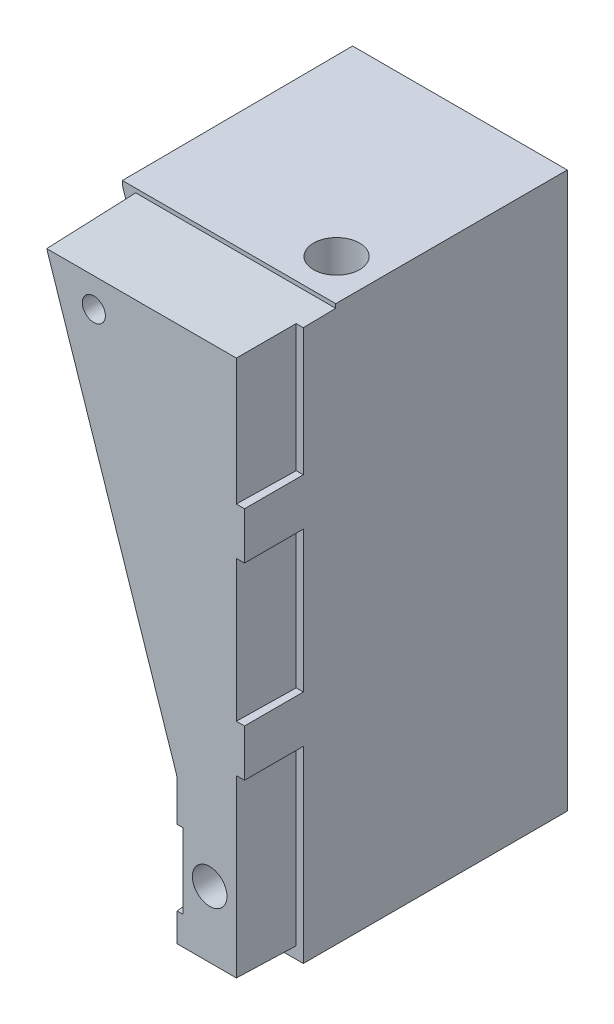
ISO-10303-21;
HEADER;
FILE_DESCRIPTION(('STEP AP214'),'2;1');
FILE_NAME('part.step','',(''),(''),'','','');
FILE_SCHEMA(('AUTOMOTIVE_DESIGN { 1 0 10303 214 1 1 1 1 }'));
ENDSEC;
DATA;
#1=APPLICATION_CONTEXT('core data for automotive mechanical design processes');
#2=APPLICATION_PROTOCOL_DEFINITION('international standard','automotive_design',2000,#1);
#3=PRODUCT_CONTEXT('',#1,'mechanical');
#4=PRODUCT('Part','Part','',(#3));
#5=PRODUCT_RELATED_PRODUCT_CATEGORY('part','',(#4));
#6=PRODUCT_DEFINITION_FORMATION('','',#4);
#7=PRODUCT_DEFINITION_CONTEXT('part definition',#1,'design');
#8=PRODUCT_DEFINITION('design','',#6,#7);
#9=PRODUCT_DEFINITION_SHAPE('','',#8);
#10=(LENGTH_UNIT() NAMED_UNIT(*) SI_UNIT(.MILLI.,.METRE.));
#11=(NAMED_UNIT(*) PLANE_ANGLE_UNIT() SI_UNIT($,.RADIAN.));
#12=(NAMED_UNIT(*) SI_UNIT($,.STERADIAN.) SOLID_ANGLE_UNIT());
#13=UNCERTAINTY_MEASURE_WITH_UNIT(LENGTH_MEASURE(1.E-05),#10,'distance_accuracy_value','');
#14=(GEOMETRIC_REPRESENTATION_CONTEXT(3) GLOBAL_UNCERTAINTY_ASSIGNED_CONTEXT((#13)) GLOBAL_UNIT_ASSIGNED_CONTEXT((#10,
#11,#12)) REPRESENTATION_CONTEXT('',''));
#15=CARTESIAN_POINT('',(0.,0.,0.));
#16=DIRECTION('',(0.,0.,1.));
#17=DIRECTION('',(1.,0.,0.));
#18=AXIS2_PLACEMENT_3D('',#15,#16,#17);
#19=CARTESIAN_POINT('',(-5.84844197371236,28.1390208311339,-56.));
#20=DIRECTION('',(1.,0.,0.));
#21=DIRECTION('',(0.,1.,0.));
#22=AXIS2_PLACEMENT_3D('',#19,#20,#21);
#23=PLANE('',#22);
#24=DIRECTION('',(0.,-1.,0.));
#25=VECTOR('',#24,1.);
#26=CARTESIAN_POINT('',(-5.84844197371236,28.1390208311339,-15.819588));
#27=LINE('',#26,#25);
#28=CARTESIAN_POINT('',(-5.84844197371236,39.2911319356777,-15.819588));
#29=VERTEX_POINT('',#28);
#30=CARTESIAN_POINT('',(-5.84844197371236,39.9924836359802,-15.819588));
#31=VERTEX_POINT('',#30);
#32=EDGE_CURVE('E545',#29,#31,#27,.F.);
#33=ORIENTED_EDGE('',*,*,#32,.F.);
#34=DIRECTION('',(0.,0.0174524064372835,-0.999847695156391));
#35=VECTOR('',#34,1.);
#36=CARTESIAN_POINT('',(-5.84844197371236,39.9888732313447,-55.7931600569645));
#37=LINE('',#36,#35);
#38=CARTESIAN_POINT('',(-5.84844197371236,39.1930416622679,-10.2));
#39=VERTEX_POINT('',#38);
#40=EDGE_CURVE('E533',#29,#39,#37,.F.);
#41=ORIENTED_EDGE('',*,*,#40,.T.);
#42=DIRECTION('',(0.,1.,0.));
#43=VECTOR('',#42,1.);
#44=CARTESIAN_POINT('',(-5.84844197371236,28.1390208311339,-10.2));
#45=LINE('',#44,#43);
#46=CARTESIAN_POINT('',(-5.84844197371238,17.085,-10.2));
#47=VERTEX_POINT('',#46);
#48=EDGE_CURVE('E451',#39,#47,#45,.F.);
#49=ORIENTED_EDGE('',*,*,#48,.T.);
#50=DIRECTION('',(0.,0.,-1.));
#51=VECTOR('',#50,1.);
#52=CARTESIAN_POINT('',(-5.84844197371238,17.085,-10.2));
#53=LINE('',#52,#51);
#54=CARTESIAN_POINT('',(-5.84844197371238,17.085,0.));
#55=VERTEX_POINT('',#54);
#56=EDGE_CURVE('E364',#55,#47,#53,.T.);
#57=ORIENTED_EDGE('',*,*,#56,.F.);
#58=DIRECTION('',(0.,1.,0.));
#59=VECTOR('',#58,1.);
#60=CARTESIAN_POINT('',(-5.84844197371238,64.515,0.));
#61=LINE('',#60,#59);
#62=CARTESIAN_POINT('',(-5.84844197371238,8.925,0.));
#63=VERTEX_POINT('',#62);
#64=EDGE_CURVE('E440',#63,#55,#61,.T.);
#65=ORIENTED_EDGE('',*,*,#64,.F.);
#66=DIRECTION('',(0.,0.,-1.));
#67=VECTOR('',#66,1.);
#68=CARTESIAN_POINT('',(-5.84844197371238,8.925,-10.2));
#69=LINE('',#68,#67);
#70=CARTESIAN_POINT('',(-5.84844197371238,8.925,-10.2));
#71=VERTEX_POINT('',#70);
#72=EDGE_CURVE('E429',#63,#71,#69,.T.);
#73=ORIENTED_EDGE('',*,*,#72,.T.);
#74=CARTESIAN_POINT('',(-5.84844197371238,-15.555,-10.2));
#75=VERTEX_POINT('',#74);
#76=EDGE_CURVE('E448',#71,#75,#45,.F.);
#77=ORIENTED_EDGE('',*,*,#76,.T.);
#78=DIRECTION('',(0.,0.,1.));
#79=VECTOR('',#78,1.);
#80=CARTESIAN_POINT('',(-5.84844197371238,-15.555,-10.2));
#81=LINE('',#80,#79);
#82=CARTESIAN_POINT('',(-5.84844197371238,-15.555,0.));
#83=VERTEX_POINT('',#82);
#84=EDGE_CURVE('E376',#75,#83,#81,.T.);
#85=ORIENTED_EDGE('',*,*,#84,.T.);
#86=CARTESIAN_POINT('',(-5.84844197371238,-23.715,0.));
#87=VERTEX_POINT('',#86);
#88=EDGE_CURVE('E442',#87,#83,#61,.T.);
#89=ORIENTED_EDGE('',*,*,#88,.F.);
#90=DIRECTION('',(0.,0.,-1.));
#91=VECTOR('',#90,1.);
#92=CARTESIAN_POINT('',(-5.84844197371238,-23.715,-10.2));
#93=LINE('',#92,#91);
#94=CARTESIAN_POINT('',(-5.84844197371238,-23.715,-10.2));
#95=VERTEX_POINT('',#94);
#96=EDGE_CURVE('E433',#87,#95,#93,.T.);
#97=ORIENTED_EDGE('',*,*,#96,.T.);
#98=CARTESIAN_POINT('',(-5.8484419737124,-56.355,-10.2));
#99=VERTEX_POINT('',#98);
#100=EDGE_CURVE('E348',#95,#99,#45,.F.);
#101=ORIENTED_EDGE('',*,*,#100,.T.);
#102=DIRECTION('',(0.,0.,-1.));
#103=VECTOR('',#102,1.);
#104=CARTESIAN_POINT('',(-5.8484419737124,-56.355,-56.));
#105=LINE('',#104,#103);
#106=CARTESIAN_POINT('',(-5.8484419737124,-56.355,-56.));
#107=VERTEX_POINT('',#106);
#108=EDGE_CURVE('E344',#99,#107,#105,.T.);
#109=ORIENTED_EDGE('',*,*,#108,.T.);
#110=DIRECTION('',(0.,1.,0.));
#111=VECTOR('',#110,1.);
#112=CARTESIAN_POINT('',(-5.84844197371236,28.1390208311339,-56.));
#113=LINE('',#112,#111);
#114=CARTESIAN_POINT('',(-5.84844197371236,39.9924906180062,-56.));
#115=VERTEX_POINT('',#114);
#116=EDGE_CURVE('E347',#107,#115,#113,.T.);
#117=ORIENTED_EDGE('',*,*,#116,.T.);
#118=DIRECTION('',(0.,0.,1.));
#119=VECTOR('',#118,1.);
#120=CARTESIAN_POINT('',(-5.84844197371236,39.9924836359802,0.168862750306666));
#121=LINE('',#120,#119);
#122=EDGE_CURVE('E547',#31,#115,#121,.F.);
#123=ORIENTED_EDGE('',*,*,#122,.F.);
#124=EDGE_LOOP('',(#33,#41,#49,#57,#65,#73,#77,#85,#89,#97,#101,#109,#117,#123));
#125=FACE_BOUND('',#124,.T.);
#126=ADVANCED_FACE('F36',(#125),#23,.T.);
#127=CARTESIAN_POINT('',(-65.6145427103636,39.9924836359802,-56.));
#128=DIRECTION('',(0.,-1.,0.));
#129=DIRECTION('',(1.,0.,0.));
#130=AXIS2_PLACEMENT_3D('',#127,#128,#129);
#131=PLANE('',#130);
#132=CARTESIAN_POINT('',(-12.8798919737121,39.9924836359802,-23.));
#133=DIRECTION('',(0.,-1.,0.));
#134=DIRECTION('',(1.,0.,0.));
#135=AXIS2_PLACEMENT_3D('',#132,#133,#134);
#136=CIRCLE('',#135,4.);
#137=CARTESIAN_POINT('',(-8.8798919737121,39.9924836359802,-23.));
#138=VERTEX_POINT('',#137);
#139=EDGE_CURVE('E515',#138,#138,#136,.T.);
#140=ORIENTED_EDGE('',*,*,#139,.T.);
#141=EDGE_LOOP('',(#140));
#142=FACE_BOUND('',#141,.T.);
#143=DIRECTION('',(-0.00584967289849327,0.,-0.999982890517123));
#144=VECTOR('',#143,1.);
#145=CARTESIAN_POINT('',(-42.7762268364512,39.9924836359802,-0.117915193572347));
#146=LINE('',#145,#144);
#147=CARTESIAN_POINT('',(-43.1031230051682,39.9924871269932,-56.));
#148=VERTEX_POINT('',#147);
#149=CARTESIAN_POINT('',(-42.8680780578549,39.9924836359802,-15.819588));
#150=VERTEX_POINT('',#149);
#151=EDGE_CURVE('E548',#148,#150,#146,.F.);
#152=ORIENTED_EDGE('',*,*,#151,.T.);
#153=DIRECTION('',(-1.,0.,0.));
#154=VECTOR('',#153,1.);
#155=CARTESIAN_POINT('',(-65.6145427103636,39.9924836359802,-15.819588));
#156=LINE('',#155,#154);
#157=EDGE_CURVE('E540',#150,#31,#156,.F.);
#158=ORIENTED_EDGE('',*,*,#157,.T.);
#159=ORIENTED_EDGE('',*,*,#122,.T.);
#160=DIRECTION('',(-1.,0.,0.));
#161=VECTOR('',#160,1.);
#162=CARTESIAN_POINT('',(-91.8,39.9924836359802,-56.));
#163=LINE('',#162,#161);
#164=EDGE_CURVE('E455',#115,#148,#163,.T.);
#165=ORIENTED_EDGE('',*,*,#164,.T.);
#166=EDGE_LOOP('',(#152,#158,#159,#165));
#167=FACE_BOUND('',#166,.T.);
#168=ADVANCED_FACE('F280',(#142,#167),#131,.F.);
#169=CARTESIAN_POINT('',(-42.7771153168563,48.6941461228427,-0.117909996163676));
#170=DIRECTION('',(0.999982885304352,0.000102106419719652,-0.00584967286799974));
#171=DIRECTION('',(-0.00584967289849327,0.,-0.999982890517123));
#172=AXIS2_PLACEMENT_3D('',#169,#170,#171);
#173=PLANE('',#172);
#174=DIRECTION('',(0.000102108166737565,-0.999999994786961,0.));
#175=VECTOR('',#174,1.);
#176=CARTESIAN_POINT('',(-42.868966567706,48.6941367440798,-15.819588));
#177=LINE('',#176,#175);
#178=CARTESIAN_POINT('',(-42.8680064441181,39.2911319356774,-15.819588));
#179=VERTEX_POINT('',#178);
#180=EDGE_CURVE('E536',#150,#179,#177,.T.);
#181=ORIENTED_EDGE('',*,*,#180,.F.);
#182=ORIENTED_EDGE('',*,*,#151,.F.);
#183=DIRECTION('',(0.00585056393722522,-0.017452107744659,0.999830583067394));
#184=VECTOR('',#183,1.);
#185=CARTESIAN_POINT('',(-42.7771153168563,39.0200056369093,-0.286772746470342));
#186=LINE('',#185,#184);
#187=EDGE_CURVE('E735',#148,#179,#186,.T.);
#188=ORIENTED_EDGE('',*,*,#187,.T.);
#189=EDGE_LOOP('',(#181,#182,#188));
#190=FACE_BOUND('',#189,.T.);
#191=ADVANCED_FACE('F286',(#190),#173,.F.);
#192=CARTESIAN_POINT('',(5.049,41.565,-10.2));
#193=DIRECTION('',(0.,0.,-1.));
#194=DIRECTION('',(-1.,0.,0.));
#195=AXIS2_PLACEMENT_3D('',#192,#193,#194);
#196=PLANE('',#195);
#197=DIRECTION('',(0.,-1.,0.));
#198=VECTOR('',#197,1.);
#199=CARTESIAN_POINT('',(-19.9112954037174,41.565,-10.2));
#200=LINE('',#199,#198);
#201=CARTESIAN_POINT('',(-19.9112954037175,-56.355,-10.2));
#202=VERTEX_POINT('',#201);
#203=CARTESIAN_POINT('',(-19.9112954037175,-54.315,-10.2));
#204=VERTEX_POINT('',#203);
#205=EDGE_CURVE('E715',#202,#204,#200,.F.);
#206=ORIENTED_EDGE('',*,*,#205,.F.);
#207=DIRECTION('',(1.,0.,0.));
#208=VECTOR('',#207,1.);
#209=CARTESIAN_POINT('',(-7.089,-56.355,-10.2));
#210=LINE('',#209,#208);
#211=EDGE_CURVE('E405',#202,#99,#210,.T.);
#212=ORIENTED_EDGE('',*,*,#211,.T.);
#213=ORIENTED_EDGE('',*,*,#100,.F.);
#214=DIRECTION('',(-1.,0.,0.));
#215=VECTOR('',#214,1.);
#216=CARTESIAN_POINT('',(-5.049,-23.715,-10.2));
#217=LINE('',#216,#215);
#218=CARTESIAN_POINT('',(-7.089,-23.715,-10.2));
#219=VERTEX_POINT('',#218);
#220=EDGE_CURVE('E406',#95,#219,#217,.T.);
#221=ORIENTED_EDGE('',*,*,#220,.T.);
#222=DIRECTION('',(0.,-1.,0.));
#223=VECTOR('',#222,1.);
#224=CARTESIAN_POINT('',(-7.089,-23.715,-10.2));
#225=LINE('',#224,#223);
#226=CARTESIAN_POINT('',(-7.089,-54.315,-10.2));
#227=VERTEX_POINT('',#226);
#228=EDGE_CURVE('E402',#219,#227,#225,.T.);
#229=ORIENTED_EDGE('',*,*,#228,.T.);
#230=DIRECTION('',(1.,0.,0.));
#231=VECTOR('',#230,1.);
#232=CARTESIAN_POINT('',(-30.6,-54.315,-10.2));
#233=LINE('',#232,#231);
#234=CARTESIAN_POINT('',(-17.6330140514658,-54.315,-10.2));
#235=VERTEX_POINT('',#234);
#236=EDGE_CURVE('E368',#235,#227,#233,.T.);
#237=ORIENTED_EDGE('',*,*,#236,.F.);
#238=DIRECTION('',(1.,0.,0.));
#239=VECTOR('',#238,1.);
#240=CARTESIAN_POINT('',(-30.6,-54.315,-10.2));
#241=LINE('',#240,#239);
#242=EDGE_CURVE('E621',#204,#235,#241,.T.);
#243=ORIENTED_EDGE('',*,*,#242,.F.);
#244=EDGE_LOOP('',(#206,#212,#213,#221,#229,#237,#243));
#245=FACE_BOUND('',#244,.T.);
#246=ADVANCED_FACE('F308',(#245),#196,.F.);
#247=CARTESIAN_POINT('',(20.4816,-44.115,-12.75));
#248=DIRECTION('',(1.,0.,0.));
#249=DIRECTION('',(0.,0.,-1.));
#250=AXIS2_PLACEMENT_3D('',#247,#248,#249);
#251=CYLINDRICAL_SURFACE('',#250,10.2);
#252=CARTESIAN_POINT('',(-19.9112954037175,-44.115,-12.75));
#253=DIRECTION('',(1.,0.,0.));
#254=DIRECTION('',(0.,1.,0.));
#255=AXIS2_PLACEMENT_3D('',#252,#253,#254);
#256=CIRCLE('',#255,10.2);
#257=CARTESIAN_POINT('',(-19.9112954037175,-54.314999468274,-12.7499999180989));
#258=VERTEX_POINT('',#257);
#259=CARTESIAN_POINT('',(-19.9112954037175,-44.115,-22.95));
#260=VERTEX_POINT('',#259);
#261=EDGE_CURVE('E432',#258,#260,#256,.T.);
#262=ORIENTED_EDGE('',*,*,#261,.F.);
#263=DIRECTION('',(-1.,0.,0.));
#264=VECTOR('',#263,1.);
#265=CARTESIAN_POINT('',(-17.544,-54.315,-12.75));
#266=LINE('',#265,#264);
#267=CARTESIAN_POINT('',(-17.6552675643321,-54.315,-12.75));
#268=VERTEX_POINT('',#267);
#269=EDGE_CURVE('E624',#258,#268,#266,.F.);
#270=ORIENTED_EDGE('',*,*,#269,.T.);
#271=CARTESIAN_POINT('',(-17.6552675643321,-44.115,-12.75));
#272=DIRECTION('',(0.999961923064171,0.,-0.00872653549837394));
#273=DIRECTION('',(0.00872653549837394,1.16435511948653E-13,0.999961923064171));
#274=AXIS2_PLACEMENT_3D('',#271,#272,#273);
#275=ELLIPSE('',#274,10.2003883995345,10.2);
#276=CARTESIAN_POINT('',(-17.7442816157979,-44.115,-22.95));
#277=VERTEX_POINT('',#276);
#278=EDGE_CURVE('E648',#268,#277,#275,.T.);
#279=ORIENTED_EDGE('',*,*,#278,.T.);
#280=DIRECTION('',(-1.,0.,0.));
#281=VECTOR('',#280,1.);
#282=CARTESIAN_POINT('',(-20.4,-44.115,-22.95));
#283=LINE('',#282,#281);
#284=EDGE_CURVE('E670',#277,#260,#283,.T.);
#285=ORIENTED_EDGE('',*,*,#284,.T.);
#286=EDGE_LOOP('',(#262,#270,#279,#285));
#287=FACE_BOUND('',#286,.T.);
#288=ADVANCED_FACE('F304',(#287),#251,.F.);
#289=CARTESIAN_POINT('',(-20.4,-54.315,-227.205));
#290=DIRECTION('',(0.,-1.,0.));
#291=DIRECTION('',(0.,0.,-1.));
#292=AXIS2_PLACEMENT_3D('',#289,#290,#291);
#293=PLANE('',#292);
#294=DIRECTION('',(0.,0.,1.));
#295=VECTOR('',#294,1.);
#296=CARTESIAN_POINT('',(-19.9112954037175,-54.315,0.0302923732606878));
#297=LINE('',#296,#295);
#298=CARTESIAN_POINT('',(-19.9112954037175,-54.315,-12.7467061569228));
#299=VERTEX_POINT('',#298);
#300=EDGE_CURVE('E738',#204,#299,#297,.F.);
#301=ORIENTED_EDGE('',*,*,#300,.F.);
#302=ORIENTED_EDGE('',*,*,#242,.T.);
#303=DIRECTION('',(0.00872653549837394,0.,0.999961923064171));
#304=VECTOR('',#303,1.);
#305=CARTESIAN_POINT('',(-19.5268544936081,-54.315,-227.212619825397));
#306=LINE('',#305,#304);
#307=EDGE_CURVE('E425',#268,#235,#306,.T.);
#308=ORIENTED_EDGE('',*,*,#307,.F.);
#309=ORIENTED_EDGE('',*,*,#269,.F.);
#310=CARTESIAN_POINT('',(-19.9112954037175,-54.315,-12.7467061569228));
#311=CARTESIAN_POINT('',(-19.9112954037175,-54.315000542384,-12.8512262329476));
#312=CARTESIAN_POINT('',(-19.9112954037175,-54.3133937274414,-12.9557462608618));
#313=CARTESIAN_POINT('',(-19.9112954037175,-54.306981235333,-13.1642990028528));
#314=CARTESIAN_POINT('',(-19.9112954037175,-54.3021874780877,-13.2683320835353));
#315=CARTESIAN_POINT('',(-19.9112954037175,-54.2894346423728,-13.4759131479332));
#316=CARTESIAN_POINT('',(-19.9112954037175,-54.281484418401,-13.5794616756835));
#317=CARTESIAN_POINT('',(-19.9112954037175,-54.2624438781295,-13.7860753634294));
#318=CARTESIAN_POINT('',(-19.9112954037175,-54.2513594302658,-13.8891410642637));
#319=CARTESIAN_POINT('',(-19.9112954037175,-54.2260665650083,-14.0947903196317));
#320=CARTESIAN_POINT('',(-19.9112954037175,-54.2118610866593,-14.1973742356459));
#321=CARTESIAN_POINT('',(-19.9112954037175,-54.1803333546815,-14.4020619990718));
#322=CARTESIAN_POINT('',(-19.9112954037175,-54.1630111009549,-14.5041658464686));
#323=CARTESIAN_POINT('',(-19.9112954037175,-54.1252481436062,-14.7078943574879));
#324=CARTESIAN_POINT('',(-19.9112954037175,-54.1048045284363,-14.8095184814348));
#325=CARTESIAN_POINT('',(-19.9112954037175,-54.0607887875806,-15.0122852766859));
#326=CARTESIAN_POINT('',(-19.9112954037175,-54.0372109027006,-15.1134266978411));
#327=CARTESIAN_POINT('',(-19.9112954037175,-53.9869077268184,-15.3152239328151));
#328=CARTESIAN_POINT('',(-19.9112954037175,-53.9601738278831,-15.415877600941));
#329=CARTESIAN_POINT('',(-19.9112954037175,-53.9035316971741,-15.6166935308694));
#330=CARTESIAN_POINT('',(-19.9112954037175,-53.8736119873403,-15.7168525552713));
#331=CARTESIAN_POINT('',(-19.9112954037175,-53.8421593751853,-15.8165279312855));
#332=B_SPLINE_CURVE_WITH_KNOTS('',3,(#310,#311,#312,#313,#314,#315,#316,#317,#318,#319,#320,
#321,#322,#323,#324,#325,#326,#327,#328,#329,#330,#331),.UNSPECIFIED.,.F.,.F.,(4,2,2,2,2,2,2,2,
2,2,4),(0.,0.313547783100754,0.625929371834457,0.937440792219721,1.24837276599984,
1.5590131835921,1.86965361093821,2.18058558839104,2.4920970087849,2.80447859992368,
3.11802639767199),.UNSPECIFIED.);
#333=EDGE_CURVE('E552',#299,#258,#332,.T.);
#334=ORIENTED_EDGE('',*,*,#333,.F.);
#335=EDGE_LOOP('',(#301,#302,#308,#309,#334));
#336=FACE_BOUND('',#335,.T.);
#337=ADVANCED_FACE('F300',(#336),#293,.F.);
#338=CARTESIAN_POINT('',(20.4816,-36.057,-16.83));
#339=DIRECTION('',(-1.,0.,0.));
#340=DIRECTION('',(0.,0.,1.));
#341=AXIS2_PLACEMENT_3D('',#338,#339,#340);
#342=CYLINDRICAL_SURFACE('',#341,6.12);
#343=CARTESIAN_POINT('',(-19.9112954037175,-36.057,-16.83));
#344=DIRECTION('',(1.,0.,0.));
#345=DIRECTION('',(0.,1.,0.));
#346=AXIS2_PLACEMENT_3D('',#343,#344,#345);
#347=CIRCLE('',#346,6.12);
#348=CARTESIAN_POINT('',(-19.9112954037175,-36.057,-22.95));
#349=VERTEX_POINT('',#348);
#350=CARTESIAN_POINT('',(-19.9112954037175,-29.937,-16.83));
#351=VERTEX_POINT('',#350);
#352=EDGE_CURVE('E687',#349,#351,#347,.T.);
#353=ORIENTED_EDGE('',*,*,#352,.F.);
#354=DIRECTION('',(1.,0.,0.));
#355=VECTOR('',#354,1.);
#356=CARTESIAN_POINT('',(-17.544,-36.057,-22.95));
#357=LINE('',#356,#355);
#358=CARTESIAN_POINT('',(-17.7442816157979,-36.057,-22.95));
#359=VERTEX_POINT('',#358);
#360=EDGE_CURVE('E340',#349,#359,#357,.T.);
#361=ORIENTED_EDGE('',*,*,#360,.T.);
#362=CARTESIAN_POINT('',(-17.6908731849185,-36.057,-16.83));
#363=DIRECTION('',(0.999961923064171,0.,-0.00872653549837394));
#364=DIRECTION('',(-0.00872653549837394,-1.16435511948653E-13,-0.999961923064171));
#365=AXIS2_PLACEMENT_3D('',#362,#363,#364);
#366=ELLIPSE('',#365,6.12023303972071,6.12);
#367=CARTESIAN_POINT('',(-17.7021267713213,-30.0743999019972,-18.1195332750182));
#368=VERTEX_POINT('',#367);
#369=EDGE_CURVE('E334',#359,#368,#366,.T.);
#370=ORIENTED_EDGE('',*,*,#369,.T.);
#371=CARTESIAN_POINT('',(-17.7021267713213,-30.0743999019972,-18.1195332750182));
#372=CARTESIAN_POINT('',(-17.701217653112,-30.0515513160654,-18.0135436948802));
#373=CARTESIAN_POINT('',(-17.7004667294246,-30.0315245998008,-17.9069450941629));
#374=CARTESIAN_POINT('',(-17.6990680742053,-29.9972079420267,-17.6931349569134));
#375=CARTESIAN_POINT('',(-17.6984200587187,-29.9829020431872,-17.5859259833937));
#376=CARTESIAN_POINT('',(-17.6970113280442,-29.959991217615,-17.3709011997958));
#377=CARTESIAN_POINT('',(-17.6962506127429,-29.9513862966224,-17.2630853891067));
#378=CARTESIAN_POINT('',(-17.6945468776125,-29.9398812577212,-17.0468466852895));
#379=CARTESIAN_POINT('',(-17.6936033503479,-29.9369972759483,-16.9384229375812));
#380=CARTESIAN_POINT('',(-17.692535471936,-29.937,-16.83));
#381=B_SPLINE_CURVE_WITH_KNOTS('',3,(#371,#372,#373,#374,#375,#376,#377,#378,#379,#380),
.UNSPECIFIED.,.F.,.F.,(4,2,2,2,4),(0.,0.325245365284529,0.649577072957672,0.973909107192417,
1.29915463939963),.UNSPECIFIED.);
#382=CARTESIAN_POINT('',(-17.692535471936,-29.937,-16.83));
#383=VERTEX_POINT('',#382);
#384=EDGE_CURVE('E327',#368,#383,#381,.T.);
#385=ORIENTED_EDGE('',*,*,#384,.T.);
#386=DIRECTION('',(1.,0.,0.));
#387=VECTOR('',#386,1.);
#388=CARTESIAN_POINT('',(-20.4,-29.937,-16.83));
#389=LINE('',#388,#387);
#390=EDGE_CURVE('E333',#383,#351,#389,.F.);
#391=ORIENTED_EDGE('',*,*,#390,.T.);
#392=EDGE_LOOP('',(#353,#361,#370,#385,#391));
#393=FACE_BOUND('',#392,.T.);
#394=ADVANCED_FACE('F303',(#393),#342,.F.);
#395=CARTESIAN_POINT('',(20.4816,-54.315,-22.95));
#396=DIRECTION('',(0.,0.,1.));
#397=DIRECTION('',(1.,0.,0.));
#398=AXIS2_PLACEMENT_3D('',#395,#396,#397);
#399=PLANE('',#398);
#400=ORIENTED_EDGE('',*,*,#360,.F.);
#401=DIRECTION('',(0.,1.,0.));
#402=VECTOR('',#401,1.);
#403=CARTESIAN_POINT('',(-19.9112954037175,-54.315,-22.95));
#404=LINE('',#403,#402);
#405=EDGE_CURVE('E685',#349,#260,#404,.F.);
#406=ORIENTED_EDGE('',*,*,#405,.T.);
#407=ORIENTED_EDGE('',*,*,#284,.F.);
#408=DIRECTION('',(0.,-1.,0.));
#409=VECTOR('',#408,1.);
#410=CARTESIAN_POINT('',(-17.7442816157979,-54.315,-22.95));
#411=LINE('',#410,#409);
#412=EDGE_CURVE('E641',#359,#277,#411,.T.);
#413=ORIENTED_EDGE('',*,*,#412,.F.);
#414=EDGE_LOOP('',(#400,#406,#407,#413));
#415=FACE_BOUND('',#414,.T.);
#416=ADVANCED_FACE('F323',(#415),#399,.T.);
#417=CARTESIAN_POINT('',(-17.544,-29.937,-227.205));
#418=DIRECTION('',(0.,1.,0.));
#419=DIRECTION('',(0.,0.,1.));
#420=AXIS2_PLACEMENT_3D('',#417,#418,#419);
#421=PLANE('',#420);
#422=DIRECTION('',(0.,0.,-1.));
#423=VECTOR('',#422,1.);
#424=CARTESIAN_POINT('',(-19.9112954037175,-29.937,-227.205));
#425=LINE('',#424,#423);
#426=CARTESIAN_POINT('',(-19.9112954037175,-29.937,-15.819588));
#427=VERTEX_POINT('',#426);
#428=EDGE_CURVE('E444',#351,#427,#425,.F.);
#429=ORIENTED_EDGE('',*,*,#428,.F.);
#430=ORIENTED_EDGE('',*,*,#390,.F.);
#431=CARTESIAN_POINT('',(-20.6607852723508,-29.937,-13.3691766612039));
#432=DIRECTION('',(0.,1.,0.));
#433=DIRECTION('',(-0.00872653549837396,0.,-0.999961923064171));
#434=AXIS2_PLACEMENT_3D('',#431,#432,#433);
#435=ELLIPSE('',#434,103.19558660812,3.);
#436=CARTESIAN_POINT('',(-17.6828834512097,-29.937,-15.819588));
#437=VERTEX_POINT('',#436);
#438=EDGE_CURVE('E337',#383,#437,#435,.F.);
#439=ORIENTED_EDGE('',*,*,#438,.T.);
#440=DIRECTION('',(-1.,0.,0.));
#441=VECTOR('',#440,1.);
#442=CARTESIAN_POINT('',(-20.4,-29.937,-15.819588));
#443=LINE('',#442,#441);
#444=EDGE_CURVE('E339',#437,#427,#443,.T.);
#445=ORIENTED_EDGE('',*,*,#444,.T.);
#446=EDGE_LOOP('',(#429,#430,#439,#445));
#447=FACE_BOUND('',#446,.T.);
#448=ADVANCED_FACE('F707',(#447),#421,.F.);
#449=CARTESIAN_POINT('',(-91.8,64.515,0.));
#450=DIRECTION('',(0.,0.,1.));
#451=DIRECTION('',(1.,0.,0.));
#452=AXIS2_PLACEMENT_3D('',#449,#450,#451);
#453=PLANE('',#452);
#454=CARTESIAN_POINT('',(-11.8955416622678,-42.687,0.));
#455=DIRECTION('',(0.,0.,1.));
#456=DIRECTION('',(0.,1.,0.));
#457=AXIS2_PLACEMENT_3D('',#454,#455,#456);
#458=CIRCLE('',#457,3.);
#459=CARTESIAN_POINT('',(-11.8955416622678,-39.687,0.));
#460=VERTEX_POINT('',#459);
#461=EDGE_CURVE('E462',#460,#460,#458,.T.);
#462=ORIENTED_EDGE('',*,*,#461,.F.);
#463=EDGE_LOOP('',(#462));
#464=FACE_BOUND('',#463,.T.);
#465=DIRECTION('',(-1.,0.,0.));
#466=VECTOR('',#465,1.);
#467=CARTESIAN_POINT('',(-5.049,-23.715,0.));
#468=LINE('',#467,#466);
#469=CARTESIAN_POINT('',(-7.26704166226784,-23.715,0.));
#470=VERTEX_POINT('',#469);
#471=EDGE_CURVE('E1276',#87,#470,#468,.T.);
#472=ORIENTED_EDGE('',*,*,#471,.F.);
#473=ORIENTED_EDGE('',*,*,#88,.T.);
#474=DIRECTION('',(1.,0.,0.));
#475=VECTOR('',#474,1.);
#476=CARTESIAN_POINT('',(-7.089,-15.555,0.));
#477=LINE('',#476,#475);
#478=CARTESIAN_POINT('',(-7.26704166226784,-15.555,0.));
#479=VERTEX_POINT('',#478);
#480=EDGE_CURVE('E412',#479,#83,#477,.T.);
#481=ORIENTED_EDGE('',*,*,#480,.F.);
#482=DIRECTION('',(0.,-1.,0.));
#483=VECTOR('',#482,1.);
#484=CARTESIAN_POINT('',(-7.26704166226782,8.925,0.));
#485=LINE('',#484,#483);
#486=CARTESIAN_POINT('',(-7.26704166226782,8.925,0.));
#487=VERTEX_POINT('',#486);
#488=EDGE_CURVE('E409',#487,#479,#485,.T.);
#489=ORIENTED_EDGE('',*,*,#488,.F.);
#490=DIRECTION('',(-1.,0.,0.));
#491=VECTOR('',#490,1.);
#492=CARTESIAN_POINT('',(-5.049,8.925,0.));
#493=LINE('',#492,#491);
#494=EDGE_CURVE('E357',#63,#487,#493,.T.);
#495=ORIENTED_EDGE('',*,*,#494,.F.);
#496=ORIENTED_EDGE('',*,*,#64,.T.);
#497=DIRECTION('',(-1.,0.,0.));
#498=VECTOR('',#497,1.);
#499=CARTESIAN_POINT('',(-5.049,17.085,0.));
#500=LINE('',#499,#498);
#501=CARTESIAN_POINT('',(-7.26704166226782,17.085,0.));
#502=VERTEX_POINT('',#501);
#503=EDGE_CURVE('E361',#55,#502,#500,.T.);
#504=ORIENTED_EDGE('',*,*,#503,.T.);
#505=DIRECTION('',(0.,-1.,0.));
#506=VECTOR('',#505,1.);
#507=CARTESIAN_POINT('',(-7.26704166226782,17.085,0.));
#508=LINE('',#507,#506);
#509=CARTESIAN_POINT('',(-7.26704166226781,39.015,0.));
#510=VERTEX_POINT('',#509);
#511=EDGE_CURVE('E353',#502,#510,#508,.F.);
#512=ORIENTED_EDGE('',*,*,#511,.T.);
#513=DIRECTION('',(1.,0.,0.));
#514=VECTOR('',#513,1.);
#515=CARTESIAN_POINT('',(-91.8,39.015,0.));
#516=LINE('',#515,#514);
#517=CARTESIAN_POINT('',(-40.1714394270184,39.015,0.));
#518=VERTEX_POINT('',#517);
#519=EDGE_CURVE('E392',#518,#510,#516,.T.);
#520=ORIENTED_EDGE('',*,*,#519,.F.);
#521=DIRECTION('',(-0.315415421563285,0.948953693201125,0.));
#522=VECTOR('',#521,1.);
#523=CARTESIAN_POINT('',(-17.2819635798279,-29.849903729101,0.));
#524=LINE('',#523,#522);
#525=CARTESIAN_POINT('',(-17.6972298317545,-28.6005404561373,0.));
#526=VERTEX_POINT('',#525);
#527=EDGE_CURVE('E377',#526,#518,#524,.T.);
#528=ORIENTED_EDGE('',*,*,#527,.F.);
#529=CARTESIAN_POINT('',(-20.5441142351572,-29.5481653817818,0.));
#530=DIRECTION('',(0.,0.,1.));
#531=DIRECTION('',(-0.287394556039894,-0.957812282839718,0.));
#532=AXIS2_PLACEMENT_3D('',#529,#530,#531);
#533=ELLIPSE('',#532,3.00138277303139,3.);
#534=CARTESIAN_POINT('',(-17.544,-29.5474039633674,0.));
#535=VERTEX_POINT('',#534);
#536=EDGE_CURVE('E349',#526,#535,#533,.F.);
#537=ORIENTED_EDGE('',*,*,#536,.T.);
#538=DIRECTION('',(0.,1.,0.));
#539=VECTOR('',#538,1.);
#540=CARTESIAN_POINT('',(-17.544,-54.315,0.));
#541=LINE('',#540,#539);
#542=CARTESIAN_POINT('',(-17.544,-36.1843230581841,0.));
#543=VERTEX_POINT('',#542);
#544=EDGE_CURVE('E396',#543,#535,#541,.T.);
#545=ORIENTED_EDGE('',*,*,#544,.F.);
#546=DIRECTION('',(-1.,0.,0.));
#547=VECTOR('',#546,1.);
#548=CARTESIAN_POINT('',(-16.524,-36.1843230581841,0.));
#549=LINE('',#548,#547);
#550=CARTESIAN_POINT('',(-16.524,-36.1843230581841,0.));
#551=VERTEX_POINT('',#550);
#552=EDGE_CURVE('E387',#551,#543,#549,.T.);
#553=ORIENTED_EDGE('',*,*,#552,.F.);
#554=DIRECTION('',(0.,1.,0.));
#555=VECTOR('',#554,1.);
#556=CARTESIAN_POINT('',(-16.524,-49.189676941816,0.));
#557=LINE('',#556,#555);
#558=CARTESIAN_POINT('',(-16.524,-49.189676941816,0.));
#559=VERTEX_POINT('',#558);
#560=EDGE_CURVE('E382',#559,#551,#557,.T.);
#561=ORIENTED_EDGE('',*,*,#560,.F.);
#562=DIRECTION('',(-1.,0.,0.));
#563=VECTOR('',#562,1.);
#564=CARTESIAN_POINT('',(-16.524,-49.189676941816,0.));
#565=LINE('',#564,#563);
#566=CARTESIAN_POINT('',(-17.544,-49.189676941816,0.));
#567=VERTEX_POINT('',#566);
#568=EDGE_CURVE('E352',#559,#567,#565,.T.);
#569=ORIENTED_EDGE('',*,*,#568,.T.);
#570=DIRECTION('',(0.,1.,0.));
#571=VECTOR('',#570,1.);
#572=CARTESIAN_POINT('',(-17.544,-54.315,0.));
#573=LINE('',#572,#571);
#574=CARTESIAN_POINT('',(-17.544,-54.1369583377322,0.));
#575=VERTEX_POINT('',#574);
#576=EDGE_CURVE('E424',#575,#567,#573,.T.);
#577=ORIENTED_EDGE('',*,*,#576,.F.);
#578=DIRECTION('',(-1.,0.,0.));
#579=VECTOR('',#578,1.);
#580=CARTESIAN_POINT('',(-30.6,-54.1369583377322,0.));
#581=LINE('',#580,#579);
#582=CARTESIAN_POINT('',(-7.26704166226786,-54.1369583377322,0.));
#583=VERTEX_POINT('',#582);
#584=EDGE_CURVE('E362',#575,#583,#581,.F.);
#585=ORIENTED_EDGE('',*,*,#584,.T.);
#586=DIRECTION('',(0.,-1.,0.));
#587=VECTOR('',#586,1.);
#588=CARTESIAN_POINT('',(-7.26704166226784,-23.715,0.));
#589=LINE('',#588,#587);
#590=EDGE_CURVE('E365',#470,#583,#589,.T.);
#591=ORIENTED_EDGE('',*,*,#590,.F.);
#592=EDGE_LOOP('',(#472,#473,#481,#489,#495,#496,#504,#512,#520,#528,#537,#545,#553,#561,#569,
#577,#585,#591));
#593=FACE_BOUND('',#592,.T.);
#594=CARTESIAN_POINT('',(-31.9999919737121,33.9924836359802,0.));
#595=DIRECTION('',(0.,0.,1.));
#596=DIRECTION('',(1.,0.,0.));
#597=AXIS2_PLACEMENT_3D('',#594,#595,#596);
#598=CIRCLE('',#597,2.);
#599=CARTESIAN_POINT('',(-29.9999919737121,33.9924836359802,0.));
#600=VERTEX_POINT('',#599);
#601=EDGE_CURVE('E508',#600,#600,#598,.T.);
#602=ORIENTED_EDGE('',*,*,#601,.F.);
#603=EDGE_LOOP('',(#602));
#604=FACE_BOUND('',#603,.T.);
#605=ADVANCED_FACE('F609',(#464,#593,#604),#453,.T.);
#606=CARTESIAN_POINT('',(-5.049,17.085,-10.2));
#607=DIRECTION('',(0.,1.,0.));
#608=DIRECTION('',(0.,0.,1.));
#609=AXIS2_PLACEMENT_3D('',#606,#607,#608);
#610=PLANE('',#609);
#611=ORIENTED_EDGE('',*,*,#503,.F.);
#612=ORIENTED_EDGE('',*,*,#56,.T.);
#613=DIRECTION('',(-1.,0.,0.));
#614=VECTOR('',#613,1.);
#615=CARTESIAN_POINT('',(-5.049,17.085,-10.2));
#616=LINE('',#615,#614);
#617=CARTESIAN_POINT('',(-7.089,17.085,-10.2));
#618=VERTEX_POINT('',#617);
#619=EDGE_CURVE('E358',#47,#618,#616,.T.);
#620=ORIENTED_EDGE('',*,*,#619,.T.);
#621=DIRECTION('',(0.0174524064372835,0.,-0.999847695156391));
#622=VECTOR('',#621,1.);
#623=CARTESIAN_POINT('',(-7.089,17.085,-10.2));
#624=LINE('',#623,#622);
#625=EDGE_CURVE('E354',#618,#502,#624,.F.);
#626=ORIENTED_EDGE('',*,*,#625,.T.);
#627=EDGE_LOOP('',(#611,#612,#620,#626));
#628=FACE_BOUND('',#627,.T.);
#629=ADVANCED_FACE('F780',(#628),#610,.T.);
#630=CARTESIAN_POINT('',(-5.049,8.925,-10.2));
#631=DIRECTION('',(0.,1.,0.));
#632=DIRECTION('',(0.,0.,1.));
#633=AXIS2_PLACEMENT_3D('',#630,#631,#632);
#634=PLANE('',#633);
#635=ORIENTED_EDGE('',*,*,#72,.F.);
#636=ORIENTED_EDGE('',*,*,#494,.T.);
#637=DIRECTION('',(-0.0174524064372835,0.,0.999847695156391));
#638=VECTOR('',#637,1.);
#639=CARTESIAN_POINT('',(-7.08837864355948,8.925,-10.2355974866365));
#640=LINE('',#639,#638);
#641=CARTESIAN_POINT('',(-7.089,8.925,-10.2));
#642=VERTEX_POINT('',#641);
#643=EDGE_CURVE('E372',#642,#487,#640,.T.);
#644=ORIENTED_EDGE('',*,*,#643,.F.);
#645=DIRECTION('',(-1.,0.,0.));
#646=VECTOR('',#645,1.);
#647=CARTESIAN_POINT('',(-5.049,8.925,-10.2));
#648=LINE('',#647,#646);
#649=EDGE_CURVE('E435',#71,#642,#648,.T.);
#650=ORIENTED_EDGE('',*,*,#649,.F.);
#651=EDGE_LOOP('',(#635,#636,#644,#650));
#652=FACE_BOUND('',#651,.T.);
#653=ADVANCED_FACE('F783',(#652),#634,.F.);
#654=CARTESIAN_POINT('',(-7.089,-15.555,-10.2));
#655=DIRECTION('',(0.,-1.,0.));
#656=DIRECTION('',(0.,0.,-1.));
#657=AXIS2_PLACEMENT_3D('',#654,#655,#656);
#658=PLANE('',#657);
#659=ORIENTED_EDGE('',*,*,#84,.F.);
#660=DIRECTION('',(1.,0.,0.));
#661=VECTOR('',#660,1.);
#662=CARTESIAN_POINT('',(-7.089,-15.555,-10.2));
#663=LINE('',#662,#661);
#664=CARTESIAN_POINT('',(-7.089,-15.555,-10.2));
#665=VERTEX_POINT('',#664);
#666=EDGE_CURVE('E418',#665,#75,#663,.T.);
#667=ORIENTED_EDGE('',*,*,#666,.F.);
#668=DIRECTION('',(-0.0174524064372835,0.,0.999847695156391));
#669=VECTOR('',#668,1.);
#670=CARTESIAN_POINT('',(-7.089,-15.555,-10.2));
#671=LINE('',#670,#669);
#672=EDGE_CURVE('E410',#665,#479,#671,.T.);
#673=ORIENTED_EDGE('',*,*,#672,.T.);
#674=ORIENTED_EDGE('',*,*,#480,.T.);
#675=EDGE_LOOP('',(#659,#667,#673,#674));
#676=FACE_BOUND('',#675,.T.);
#677=ADVANCED_FACE('F787',(#676),#658,.F.);
#678=CARTESIAN_POINT('',(-5.049,-23.715,-10.2));
#679=DIRECTION('',(0.,1.,0.));
#680=DIRECTION('',(0.,0.,1.));
#681=AXIS2_PLACEMENT_3D('',#678,#679,#680);
#682=PLANE('',#681);
#683=ORIENTED_EDGE('',*,*,#96,.F.);
#684=ORIENTED_EDGE('',*,*,#471,.T.);
#685=DIRECTION('',(-0.0174524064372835,0.,0.999847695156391));
#686=VECTOR('',#685,1.);
#687=CARTESIAN_POINT('',(-7.0883786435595,-23.715,-10.2355974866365));
#688=LINE('',#687,#686);
#689=EDGE_CURVE('E369',#219,#470,#688,.T.);
#690=ORIENTED_EDGE('',*,*,#689,.F.);
#691=ORIENTED_EDGE('',*,*,#220,.F.);
#692=EDGE_LOOP('',(#683,#684,#690,#691));
#693=FACE_BOUND('',#692,.T.);
#694=ADVANCED_FACE('F791',(#693),#682,.F.);
#695=DIRECTION('',(0.,1.,0.));
#696=VECTOR('',#695,1.);
#697=CARTESIAN_POINT('',(-7.089,17.085,-10.2));
#698=LINE('',#697,#696);
#699=CARTESIAN_POINT('',(-7.089,39.1930416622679,-10.2));
#700=VERTEX_POINT('',#699);
#701=EDGE_CURVE('E415',#618,#700,#698,.T.);
#702=ORIENTED_EDGE('',*,*,#701,.F.);
#703=ORIENTED_EDGE('',*,*,#619,.F.);
#704=ORIENTED_EDGE('',*,*,#48,.F.);
#705=DIRECTION('',(1.,0.,0.));
#706=VECTOR('',#705,1.);
#707=CARTESIAN_POINT('',(-91.8,39.1930416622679,-10.2));
#708=LINE('',#707,#706);
#709=EDGE_CURVE('E394',#700,#39,#708,.T.);
#710=ORIENTED_EDGE('',*,*,#709,.F.);
#711=EDGE_LOOP('',(#702,#703,#704,#710));
#712=FACE_BOUND('',#711,.T.);
#713=ADVANCED_FACE('F319',(#712),#196,.F.);
#714=CARTESIAN_POINT('',(-16.524,-49.189676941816,0.));
#715=DIRECTION('',(0.999961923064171,0.,-0.00872653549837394));
#716=DIRECTION('',(-0.00872653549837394,0.,-0.999961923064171));
#717=AXIS2_PLACEMENT_3D('',#714,#715,#716);
#718=PLANE('',#717);
#719=DIRECTION('',(-0.0086933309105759,0.0871524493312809,-0.996157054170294));
#720=VECTOR('',#719,1.);
#721=CARTESIAN_POINT('',(-16.524,-49.189676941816,0.));
#722=LINE('',#721,#720);
#723=CARTESIAN_POINT('',(-16.6658508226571,-47.7675929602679,-16.254494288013));
#724=VERTEX_POINT('',#723);
#725=EDGE_CURVE('E386',#724,#559,#722,.F.);
#726=ORIENTED_EDGE('',*,*,#725,.T.);
#727=ORIENTED_EDGE('',*,*,#560,.T.);
#728=DIRECTION('',(0.0086933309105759,0.08715244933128,0.996157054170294));
#729=VECTOR('',#728,1.);
#730=CARTESIAN_POINT('',(-16.5338534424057,-36.2831058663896,-1.12909266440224));
#731=LINE('',#730,#729);
#732=CARTESIAN_POINT('',(-16.6658508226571,-37.6064070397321,-16.254494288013));
#733=VERTEX_POINT('',#732);
#734=EDGE_CURVE('E385',#551,#733,#731,.F.);
#735=ORIENTED_EDGE('',*,*,#734,.T.);
#736=CARTESIAN_POINT('',(-16.6619717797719,-42.687,-15.81));
#737=DIRECTION('',(0.999961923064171,0.,-0.00872653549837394));
#738=DIRECTION('',(-0.00872653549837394,0.,-0.999961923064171));
#739=AXIS2_PLACEMENT_3D('',#736,#737,#738);
#740=ELLIPSE('',#739,5.10019419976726,5.1);
#741=EDGE_CURVE('E391',#733,#724,#740,.F.);
#742=ORIENTED_EDGE('',*,*,#741,.T.);
#743=EDGE_LOOP('',(#726,#727,#735,#742));
#744=FACE_BOUND('',#743,.T.);
#745=ADVANCED_FACE('F576',(#744),#718,.F.);
#746=CARTESIAN_POINT('',(-16.524,-36.1843230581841,0.));
#747=DIRECTION('',(0.,0.996194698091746,-0.0871557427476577));
#748=DIRECTION('',(0.,0.0871557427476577,0.996194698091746));
#749=AXIS2_PLACEMENT_3D('',#746,#747,#748);
#750=PLANE('',#749);
#751=ORIENTED_EDGE('',*,*,#734,.F.);
#752=ORIENTED_EDGE('',*,*,#552,.T.);
#753=DIRECTION('',(-0.00869333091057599,-0.08715244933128,-0.996157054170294));
#754=VECTOR('',#753,1.);
#755=CARTESIAN_POINT('',(-17.5439229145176,-36.1835502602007,0.00883312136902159));
#756=LINE('',#755,#754);
#757=CARTESIAN_POINT('',(-17.6858508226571,-37.6064070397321,-16.254494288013));
#758=VERTEX_POINT('',#757);
#759=EDGE_CURVE('E390',#543,#758,#756,.T.);
#760=ORIENTED_EDGE('',*,*,#759,.T.);
#761=DIRECTION('',(-1.,0.,0.));
#762=VECTOR('',#761,1.);
#763=CARTESIAN_POINT('',(-16.524,-37.6064070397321,-16.254494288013));
#764=LINE('',#763,#762);
#765=EDGE_CURVE('E638',#733,#758,#764,.T.);
#766=ORIENTED_EDGE('',*,*,#765,.F.);
#767=EDGE_LOOP('',(#751,#752,#760,#766));
#768=FACE_BOUND('',#767,.T.);
#769=ADVANCED_FACE('F579',(#768),#750,.F.);
#770=CARTESIAN_POINT('',(-17.544,-54.315,0.));
#771=DIRECTION('',(0.999961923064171,0.,-0.00872653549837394));
#772=DIRECTION('',(-0.00872653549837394,0.,-0.999961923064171));
#773=AXIS2_PLACEMENT_3D('',#770,#771,#772);
#774=PLANE('',#773);
#775=ORIENTED_EDGE('',*,*,#759,.F.);
#776=ORIENTED_EDGE('',*,*,#544,.T.);
#777=DIRECTION('',(0.00872284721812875,0.0290710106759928,0.999539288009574));
#778=VECTOR('',#777,1.);
#779=CARTESIAN_POINT('',(-17.6819322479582,-30.0070967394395,-15.8054701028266));
#780=LINE('',#779,#778);
#781=EDGE_CURVE('E399',#535,#368,#780,.F.);
#782=ORIENTED_EDGE('',*,*,#781,.T.);
#783=ORIENTED_EDGE('',*,*,#369,.F.);
#784=ORIENTED_EDGE('',*,*,#412,.T.);
#785=ORIENTED_EDGE('',*,*,#278,.F.);
#786=ORIENTED_EDGE('',*,*,#307,.T.);
#787=DIRECTION('',(-0.0087252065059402,-0.0174517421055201,-0.999809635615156));
#788=VECTOR('',#787,1.);
#789=CARTESIAN_POINT('',(-17.6340012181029,-54.3169744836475,-10.3131180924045));
#790=LINE('',#789,#788);
#791=EDGE_CURVE('E421',#235,#575,#790,.F.);
#792=ORIENTED_EDGE('',*,*,#791,.T.);
#793=ORIENTED_EDGE('',*,*,#576,.T.);
#794=DIRECTION('',(0.00869333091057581,-0.0871524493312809,0.996157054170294));
#795=VECTOR('',#794,1.);
#796=CARTESIAN_POINT('',(-17.6857630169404,-47.7684732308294,-16.244432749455));
#797=LINE('',#796,#795);
#798=CARTESIAN_POINT('',(-17.6858508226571,-47.7675929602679,-16.254494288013));
#799=VERTEX_POINT('',#798);
#800=EDGE_CURVE('E631',#799,#567,#797,.T.);
#801=ORIENTED_EDGE('',*,*,#800,.F.);
#802=CARTESIAN_POINT('',(-17.6819717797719,-42.687,-15.81));
#803=DIRECTION('',(0.999961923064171,0.,-0.00872653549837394));
#804=DIRECTION('',(-0.00872653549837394,-1.1643551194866E-13,-0.999961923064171));
#805=AXIS2_PLACEMENT_3D('',#802,#803,#804);
#806=ELLIPSE('',#805,5.10019419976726,5.1);
#807=EDGE_CURVE('E438',#758,#799,#806,.F.);
#808=ORIENTED_EDGE('',*,*,#807,.F.);
#809=EDGE_LOOP('',(#775,#776,#782,#783,#784,#785,#786,#792,#793,#801,#808));
#810=FACE_BOUND('',#809,.T.);
#811=ADVANCED_FACE('F588',(#810),#774,.F.);
#812=CARTESIAN_POINT('',(-17.544,-29.937,-15.819588));
#813=DIRECTION('',(0.94880916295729,0.315367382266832,-0.0174524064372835));
#814=DIRECTION('',(-0.315415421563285,0.948953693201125,0.));
#815=AXIS2_PLACEMENT_3D('',#812,#813,#814);
#816=PLANE('',#815);
#817=DIRECTION('',(0.00872284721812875,0.0290710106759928,0.999539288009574));
#818=VECTOR('',#817,1.);
#819=CARTESIAN_POINT('',(-17.6973350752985,-28.6008912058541,-0.0120597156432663));
#820=LINE('',#819,#818);
#821=CARTESIAN_POINT('',(-17.8352852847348,-29.0606438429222,-15.819588));
#822=VERTEX_POINT('',#821);
#823=EDGE_CURVE('E381',#822,#526,#820,.T.);
#824=ORIENTED_EDGE('',*,*,#823,.T.);
#825=ORIENTED_EDGE('',*,*,#527,.T.);
#826=DIRECTION('',(0.0241850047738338,-0.0174473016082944,0.999555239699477));
#827=VECTOR('',#826,1.);
#828=CARTESIAN_POINT('',(-40.2016377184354,39.0367853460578,-1.24808163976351));
#829=LINE('',#828,#827);
#830=CARTESIAN_POINT('',(-40.5542064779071,39.2911319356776,-15.819588));
#831=VERTEX_POINT('',#830);
#832=EDGE_CURVE('E395',#831,#518,#829,.T.);
#833=ORIENTED_EDGE('',*,*,#832,.F.);
#834=DIRECTION('',(0.315415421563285,-0.948953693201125,0.));
#835=VECTOR('',#834,1.);
#836=CARTESIAN_POINT('',(-17.544,-29.937,-15.819588));
#837=LINE('',#836,#835);
#838=EDGE_CURVE('E380',#831,#822,#837,.T.);
#839=ORIENTED_EDGE('',*,*,#838,.T.);
#840=EDGE_LOOP('',(#824,#825,#833,#839));
#841=FACE_BOUND('',#840,.T.);
#842=ADVANCED_FACE('F584',(#841),#816,.F.);
#843=CARTESIAN_POINT('',(-16.524,-47.7675929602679,-16.254494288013));
#844=DIRECTION('',(0.,-0.996194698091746,-0.0871557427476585));
#845=DIRECTION('',(0.,0.0871557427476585,-0.996194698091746));
#846=AXIS2_PLACEMENT_3D('',#843,#844,#845);
#847=PLANE('',#846);
#848=ORIENTED_EDGE('',*,*,#800,.T.);
#849=ORIENTED_EDGE('',*,*,#568,.F.);
#850=ORIENTED_EDGE('',*,*,#725,.F.);
#851=DIRECTION('',(-1.,0.,0.));
#852=VECTOR('',#851,1.);
#853=CARTESIAN_POINT('',(-16.524,-47.7675929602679,-16.254494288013));
#854=LINE('',#853,#852);
#855=EDGE_CURVE('E667',#724,#799,#854,.T.);
#856=ORIENTED_EDGE('',*,*,#855,.T.);
#857=EDGE_LOOP('',(#848,#849,#850,#856));
#858=FACE_BOUND('',#857,.T.);
#859=ADVANCED_FACE('F581',(#858),#847,.F.);
#860=CARTESIAN_POINT('',(-20.6819128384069,-30.0074127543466,-15.7901559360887));
#861=DIRECTION('',(-0.00872284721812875,-0.0290710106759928,-0.999539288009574));
#862=DIRECTION('',(0.,0.999577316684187,-0.0290721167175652));
#863=AXIS2_PLACEMENT_3D('',#860,#861,#862);
#864=CYLINDRICAL_SURFACE('',#863,3.);
#865=ORIENTED_EDGE('',*,*,#781,.F.);
#866=ORIENTED_EDGE('',*,*,#536,.F.);
#867=ORIENTED_EDGE('',*,*,#823,.F.);
#868=CARTESIAN_POINT('',(-20.6821696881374,-30.0082687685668,-15.819588));
#869=DIRECTION('',(0.,0.,1.));
#870=DIRECTION('',(-0.287394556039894,-0.957812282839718,0.));
#871=AXIS2_PLACEMENT_3D('',#868,#869,#870);
#872=ELLIPSE('',#871,3.00138277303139,3.);
#873=EDGE_CURVE('E341',#437,#822,#872,.T.);
#874=ORIENTED_EDGE('',*,*,#873,.F.);
#875=ORIENTED_EDGE('',*,*,#438,.F.);
#876=ORIENTED_EDGE('',*,*,#384,.F.);
#877=EDGE_LOOP('',(#865,#866,#867,#874,#875,#876));
#878=FACE_BOUND('',#877,.T.);
#879=ADVANCED_FACE('F292',(#878),#864,.F.);
#880=CARTESIAN_POINT('',(170.,-124.,-56.));
#881=DIRECTION('',(0.,0.,1.));
#882=DIRECTION('',(1.,0.,0.));
#883=AXIS2_PLACEMENT_3D('',#880,#881,#882);
#884=PLANE('',#883);
#885=CARTESIAN_POINT('',(-14.9999830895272,-16.999997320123,-56.));
#886=DIRECTION('',(0.,0.,1.));
#887=DIRECTION('',(1.,0.,0.));
#888=AXIS2_PLACEMENT_3D('',#885,#886,#887);
#889=CIRCLE('',#888,4.);
#890=CARTESIAN_POINT('',(-10.9999830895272,-16.999997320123,-56.));
#891=VERTEX_POINT('',#890);
#892=EDGE_CURVE('E44',#891,#891,#889,.T.);
#893=ORIENTED_EDGE('',*,*,#892,.T.);
#894=EDGE_LOOP('',(#893));
#895=FACE_BOUND('',#894,.T.);
#896=CARTESIAN_POINT('',(-25.000006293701,24.1988764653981,-56.));
#897=DIRECTION('',(0.,0.,1.));
#898=DIRECTION('',(1.,0.,0.));
#899=AXIS2_PLACEMENT_3D('',#896,#897,#898);
#900=CIRCLE('',#899,4.);
#901=CARTESIAN_POINT('',(-21.000006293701,24.1988764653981,-56.));
#902=VERTEX_POINT('',#901);
#903=EDGE_CURVE('E481',#902,#902,#900,.T.);
#904=ORIENTED_EDGE('',*,*,#903,.T.);
#905=EDGE_LOOP('',(#904));
#906=FACE_BOUND('',#905,.T.);
#907=CARTESIAN_POINT('',(-12.8798919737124,-30.,-56.));
#908=DIRECTION('',(0.,0.,1.));
#909=DIRECTION('',(1.,0.,0.));
#910=AXIS2_PLACEMENT_3D('',#907,#908,#909);
#911=CIRCLE('',#910,4.);
#912=CARTESIAN_POINT('',(-8.8798919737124,-30.,-56.));
#913=VERTEX_POINT('',#912);
#914=EDGE_CURVE('E505',#913,#913,#911,.T.);
#915=ORIENTED_EDGE('',*,*,#914,.T.);
#916=EDGE_LOOP('',(#915));
#917=FACE_BOUND('',#916,.T.);
#918=CARTESIAN_POINT('',(-12.8798919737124,20.,-56.));
#919=DIRECTION('',(0.,0.,1.));
#920=DIRECTION('',(1.,0.,0.));
#921=AXIS2_PLACEMENT_3D('',#918,#919,#920);
#922=CIRCLE('',#921,4.);
#923=CARTESIAN_POINT('',(-8.8798919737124,20.,-56.));
#924=VERTEX_POINT('',#923);
#925=EDGE_CURVE('E521',#924,#924,#922,.T.);
#926=ORIENTED_EDGE('',*,*,#925,.T.);
#927=EDGE_LOOP('',(#926));
#928=FACE_BOUND('',#927,.T.);
#929=CARTESIAN_POINT('',(-11.8955416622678,-42.687,-56.));
#930=DIRECTION('',(0.,0.,1.));
#931=DIRECTION('',(1.,0.,0.));
#932=AXIS2_PLACEMENT_3D('',#929,#930,#931);
#933=CIRCLE('',#932,3.);
#934=CARTESIAN_POINT('',(-8.89554166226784,-42.687,-56.));
#935=VERTEX_POINT('',#934);
#936=EDGE_CURVE('E458',#935,#935,#933,.T.);
#937=ORIENTED_EDGE('',*,*,#936,.T.);
#938=EDGE_LOOP('',(#937));
#939=FACE_BOUND('',#938,.T.);
#940=ORIENTED_EDGE('',*,*,#164,.F.);
#941=ORIENTED_EDGE('',*,*,#116,.F.);
#942=DIRECTION('',(-1.,0.,0.));
#943=VECTOR('',#942,1.);
#944=CARTESIAN_POINT('',(-7.089,-56.355,-56.));
#945=LINE('',#944,#943);
#946=CARTESIAN_POINT('',(-19.9112954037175,-56.355,-56.));
#947=VERTEX_POINT('',#946);
#948=EDGE_CURVE('E335',#947,#107,#945,.F.);
#949=ORIENTED_EDGE('',*,*,#948,.F.);
#950=DIRECTION('',(0.,-1.,0.));
#951=VECTOR('',#950,1.);
#952=CARTESIAN_POINT('',(-19.9112954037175,-42.2888654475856,-56.));
#953=LINE('',#952,#951);
#954=CARTESIAN_POINT('',(-19.9112954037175,-29.188248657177,-56.));
#955=VERTEX_POINT('',#954);
#956=EDGE_CURVE('E660',#955,#947,#953,.T.);
#957=ORIENTED_EDGE('',*,*,#956,.F.);
#958=DIRECTION('',(0.317850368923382,-0.948140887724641,0.));
#959=VECTOR('',#958,1.);
#960=CARTESIAN_POINT('',(-31.2110349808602,4.5186340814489,-56.));
#961=LINE('',#960,#959);
#962=EDGE_CURVE('E662',#148,#955,#961,.T.);
#963=ORIENTED_EDGE('',*,*,#962,.F.);
#964=EDGE_LOOP('',(#940,#941,#949,#957,#963));
#965=FACE_BOUND('',#964,.T.);
#966=CARTESIAN_POINT('',(-31.9999919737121,33.9924836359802,-56.));
#967=DIRECTION('',(0.,0.,1.));
#968=DIRECTION('',(1.,0.,0.));
#969=AXIS2_PLACEMENT_3D('',#966,#967,#968);
#970=CIRCLE('',#969,2.);
#971=CARTESIAN_POINT('',(-29.9999919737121,33.9924836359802,-56.));
#972=VERTEX_POINT('',#971);
#973=EDGE_CURVE('E502',#972,#972,#970,.F.);
#974=ORIENTED_EDGE('',*,*,#973,.F.);
#975=EDGE_LOOP('',(#974));
#976=FACE_BOUND('',#975,.T.);
#977=ADVANCED_FACE('F295',(#895,#906,#917,#928,#939,#965,#976),#884,.F.);
#978=CARTESIAN_POINT('',(-7.089,-56.355,-10.2));
#979=DIRECTION('',(0.,-1.,0.));
#980=DIRECTION('',(0.,0.,-1.));
#981=AXIS2_PLACEMENT_3D('',#978,#979,#980);
#982=PLANE('',#981);
#983=ORIENTED_EDGE('',*,*,#211,.F.);
#984=DIRECTION('',(0.,0.,-1.));
#985=VECTOR('',#984,1.);
#986=CARTESIAN_POINT('',(-19.9112954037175,-56.355,-56.));
#987=LINE('',#986,#985);
#988=EDGE_CURVE('E691',#202,#947,#987,.T.);
#989=ORIENTED_EDGE('',*,*,#988,.T.);
#990=ORIENTED_EDGE('',*,*,#948,.T.);
#991=ORIENTED_EDGE('',*,*,#108,.F.);
#992=EDGE_LOOP('',(#983,#989,#990,#991));
#993=FACE_BOUND('',#992,.T.);
#994=ADVANCED_FACE('F298',(#993),#982,.T.);
#995=CARTESIAN_POINT('',(91.8,39.015,-15.819588));
#996=DIRECTION('',(0.,0.,1.));
#997=DIRECTION('',(1.,0.,0.));
#998=AXIS2_PLACEMENT_3D('',#995,#996,#997);
#999=PLANE('',#998);
#1000=DIRECTION('',(0.,-1.,0.));
#1001=VECTOR('',#1000,1.);
#1002=CARTESIAN_POINT('',(-19.9112954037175,-29.937,-15.819588));
#1003=LINE('',#1002,#1001);
#1004=CARTESIAN_POINT('',(-19.9112954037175,-29.188248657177,-15.819588));
#1005=VERTEX_POINT('',#1004);
#1006=EDGE_CURVE('E688',#427,#1005,#1003,.F.);
#1007=ORIENTED_EDGE('',*,*,#1006,.F.);
#1008=ORIENTED_EDGE('',*,*,#444,.F.);
#1009=ORIENTED_EDGE('',*,*,#873,.T.);
#1010=ORIENTED_EDGE('',*,*,#838,.F.);
#1011=DIRECTION('',(1.,0.,0.));
#1012=VECTOR('',#1011,1.);
#1013=CARTESIAN_POINT('',(91.8,39.2911319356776,-15.819588));
#1014=LINE('',#1013,#1012);
#1015=EDGE_CURVE('E461',#831,#29,#1014,.T.);
#1016=ORIENTED_EDGE('',*,*,#1015,.T.);
#1017=ORIENTED_EDGE('',*,*,#32,.T.);
#1018=ORIENTED_EDGE('',*,*,#157,.F.);
#1019=ORIENTED_EDGE('',*,*,#180,.T.);
#1020=DIRECTION('',(0.317850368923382,-0.948140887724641,0.));
#1021=VECTOR('',#1020,1.);
#1022=CARTESIAN_POINT('',(-31.2110349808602,4.5186340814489,-15.819588));
#1023=LINE('',#1022,#1021);
#1024=EDGE_CURVE('E706',#179,#1005,#1023,.T.);
#1025=ORIENTED_EDGE('',*,*,#1024,.T.);
#1026=EDGE_LOOP('',(#1007,#1008,#1009,#1010,#1016,#1017,#1018,#1019,#1025));
#1027=FACE_BOUND('',#1026,.T.);
#1028=ADVANCED_FACE('F310',(#1027),#999,.T.);
#1029=DIRECTION('',(0.,-1.,0.));
#1030=VECTOR('',#1029,1.);
#1031=CARTESIAN_POINT('',(-7.089,8.925,-10.2));
#1032=LINE('',#1031,#1030);
#1033=EDGE_CURVE('E343',#642,#665,#1032,.T.);
#1034=ORIENTED_EDGE('',*,*,#1033,.T.);
#1035=ORIENTED_EDGE('',*,*,#666,.T.);
#1036=ORIENTED_EDGE('',*,*,#76,.F.);
#1037=ORIENTED_EDGE('',*,*,#649,.T.);
#1038=EDGE_LOOP('',(#1034,#1035,#1036,#1037));
#1039=FACE_BOUND('',#1038,.T.);
#1040=ADVANCED_FACE('F313',(#1039),#196,.F.);
#1041=CARTESIAN_POINT('',(-16.524,-42.687,-15.81));
#1042=DIRECTION('',(-1.,0.,0.));
#1043=DIRECTION('',(0.,0.,1.));
#1044=AXIS2_PLACEMENT_3D('',#1041,#1042,#1043);
#1045=CYLINDRICAL_SURFACE('',#1044,5.1);
#1046=ORIENTED_EDGE('',*,*,#807,.T.);
#1047=ORIENTED_EDGE('',*,*,#855,.F.);
#1048=ORIENTED_EDGE('',*,*,#741,.F.);
#1049=ORIENTED_EDGE('',*,*,#765,.T.);
#1050=EDGE_LOOP('',(#1046,#1047,#1048,#1049));
#1051=FACE_BOUND('',#1050,.T.);
#1052=ADVANCED_FACE('F317',(#1051),#1045,.F.);
#1053=CARTESIAN_POINT('',(-7.089,17.085,-10.2));
#1054=DIRECTION('',(-0.999847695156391,0.,-0.0174524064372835));
#1055=DIRECTION('',(-0.0174524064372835,0.,0.999847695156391));
#1056=AXIS2_PLACEMENT_3D('',#1053,#1054,#1055);
#1057=PLANE('',#1056);
#1058=DIRECTION('',(0.0174497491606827,0.0174497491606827,-0.999695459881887));
#1059=VECTOR('',#1058,1.);
#1060=CARTESIAN_POINT('',(-7.29278141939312,38.9892602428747,1.47462969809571));
#1061=LINE('',#1060,#1059);
#1062=EDGE_CURVE('E614',#700,#510,#1061,.F.);
#1063=ORIENTED_EDGE('',*,*,#1062,.T.);
#1064=ORIENTED_EDGE('',*,*,#511,.F.);
#1065=ORIENTED_EDGE('',*,*,#625,.F.);
#1066=ORIENTED_EDGE('',*,*,#701,.T.);
#1067=EDGE_LOOP('',(#1063,#1064,#1065,#1066));
#1068=FACE_BOUND('',#1067,.T.);
#1069=ADVANCED_FACE('F617',(#1068),#1057,.F.);
#1070=CARTESIAN_POINT('',(-7.089,8.925,-10.2));
#1071=DIRECTION('',(-0.999847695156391,0.,-0.0174524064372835));
#1072=DIRECTION('',(-0.0174524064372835,0.,0.999847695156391));
#1073=AXIS2_PLACEMENT_3D('',#1070,#1071,#1072);
#1074=PLANE('',#1073);
#1075=ORIENTED_EDGE('',*,*,#488,.T.);
#1076=ORIENTED_EDGE('',*,*,#672,.F.);
#1077=ORIENTED_EDGE('',*,*,#1033,.F.);
#1078=ORIENTED_EDGE('',*,*,#643,.T.);
#1079=EDGE_LOOP('',(#1075,#1076,#1077,#1078));
#1080=FACE_BOUND('',#1079,.T.);
#1081=ADVANCED_FACE('F766',(#1080),#1074,.F.);
#1082=CARTESIAN_POINT('',(-7.089,-23.715,-10.2));
#1083=DIRECTION('',(-0.999847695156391,0.,-0.0174524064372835));
#1084=DIRECTION('',(-0.0174524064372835,0.,0.999847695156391));
#1085=AXIS2_PLACEMENT_3D('',#1082,#1083,#1084);
#1086=PLANE('',#1085);
#1087=ORIENTED_EDGE('',*,*,#228,.F.);
#1088=ORIENTED_EDGE('',*,*,#689,.T.);
#1089=ORIENTED_EDGE('',*,*,#590,.T.);
#1090=DIRECTION('',(0.0174497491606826,-0.0174497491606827,-0.999695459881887));
#1091=VECTOR('',#1090,1.);
#1092=CARTESIAN_POINT('',(-7.09831750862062,-54.3056824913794,-9.66620028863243));
#1093=LINE('',#1092,#1091);
#1094=EDGE_CURVE('E373',#227,#583,#1093,.F.);
#1095=ORIENTED_EDGE('',*,*,#1094,.F.);
#1096=EDGE_LOOP('',(#1087,#1088,#1089,#1095));
#1097=FACE_BOUND('',#1096,.T.);
#1098=ADVANCED_FACE('F773',(#1097),#1086,.F.);
#1099=CARTESIAN_POINT('',(-30.6,-54.315,-10.2));
#1100=DIRECTION('',(0.,0.999847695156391,-0.0174524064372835));
#1101=DIRECTION('',(0.,0.0174524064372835,0.999847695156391));
#1102=AXIS2_PLACEMENT_3D('',#1099,#1100,#1101);
#1103=PLANE('',#1102);
#1104=ORIENTED_EDGE('',*,*,#584,.F.);
#1105=ORIENTED_EDGE('',*,*,#791,.F.);
#1106=ORIENTED_EDGE('',*,*,#236,.T.);
#1107=ORIENTED_EDGE('',*,*,#1094,.T.);
#1108=EDGE_LOOP('',(#1104,#1105,#1106,#1107));
#1109=FACE_BOUND('',#1108,.T.);
#1110=ADVANCED_FACE('F574',(#1109),#1103,.F.);
#1111=CARTESIAN_POINT('',(-19.9112954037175,-29.937,-56.));
#1112=DIRECTION('',(1.,0.,0.));
#1113=DIRECTION('',(0.,1.,0.));
#1114=AXIS2_PLACEMENT_3D('',#1111,#1112,#1113);
#1115=PLANE('',#1114);
#1116=ORIENTED_EDGE('',*,*,#428,.T.);
#1117=ORIENTED_EDGE('',*,*,#1006,.T.);
#1118=DIRECTION('',(0.,0.,1.));
#1119=VECTOR('',#1118,1.);
#1120=CARTESIAN_POINT('',(-19.9112954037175,-29.188248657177,-56.));
#1121=LINE('',#1120,#1119);
#1122=EDGE_CURVE('E694',#1005,#955,#1121,.F.);
#1123=ORIENTED_EDGE('',*,*,#1122,.T.);
#1124=ORIENTED_EDGE('',*,*,#956,.T.);
#1125=ORIENTED_EDGE('',*,*,#988,.F.);
#1126=ORIENTED_EDGE('',*,*,#205,.T.);
#1127=ORIENTED_EDGE('',*,*,#300,.T.);
#1128=ORIENTED_EDGE('',*,*,#333,.T.);
#1129=ORIENTED_EDGE('',*,*,#261,.T.);
#1130=ORIENTED_EDGE('',*,*,#405,.F.);
#1131=ORIENTED_EDGE('',*,*,#352,.T.);
#1132=EDGE_LOOP('',(#1116,#1117,#1123,#1124,#1125,#1126,#1127,#1128,#1129,#1130,#1131));
#1133=FACE_BOUND('',#1132,.T.);
#1134=ADVANCED_FACE('F569',(#1133),#1115,.F.);
#1135=CARTESIAN_POINT('',(-31.2110349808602,4.5186340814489,-56.));
#1136=DIRECTION('',(0.948140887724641,0.317850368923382,0.));
#1137=DIRECTION('',(-0.317850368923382,0.948140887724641,0.));
#1138=AXIS2_PLACEMENT_3D('',#1135,#1136,#1137);
#1139=PLANE('',#1138);
#1140=ORIENTED_EDGE('',*,*,#187,.F.);
#1141=ORIENTED_EDGE('',*,*,#962,.T.);
#1142=ORIENTED_EDGE('',*,*,#1122,.F.);
#1143=ORIENTED_EDGE('',*,*,#1024,.F.);
#1144=EDGE_LOOP('',(#1140,#1141,#1142,#1143));
#1145=FACE_BOUND('',#1144,.T.);
#1146=ADVANCED_FACE('F566',(#1145),#1139,.F.);
#1147=CARTESIAN_POINT('',(-91.8,39.015,0.));
#1148=DIRECTION('',(0.,-0.999847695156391,-0.0174524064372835));
#1149=DIRECTION('',(0.,0.0174524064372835,-0.999847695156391));
#1150=AXIS2_PLACEMENT_3D('',#1147,#1148,#1149);
#1151=PLANE('',#1150);
#1152=ORIENTED_EDGE('',*,*,#1015,.F.);
#1153=ORIENTED_EDGE('',*,*,#832,.T.);
#1154=ORIENTED_EDGE('',*,*,#519,.T.);
#1155=ORIENTED_EDGE('',*,*,#1062,.F.);
#1156=ORIENTED_EDGE('',*,*,#709,.T.);
#1157=ORIENTED_EDGE('',*,*,#40,.F.);
#1158=EDGE_LOOP('',(#1152,#1153,#1154,#1155,#1156,#1157));
#1159=FACE_BOUND('',#1158,.T.);
#1160=ADVANCED_FACE('F568',(#1159),#1151,.F.);
#1161=CARTESIAN_POINT('',(-11.8955416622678,-42.687,-106.));
#1162=DIRECTION('',(0.,0.,1.));
#1163=DIRECTION('',(1.,0.,0.));
#1164=AXIS2_PLACEMENT_3D('',#1161,#1162,#1163);
#1165=CYLINDRICAL_SURFACE('',#1164,3.);
#1166=ORIENTED_EDGE('',*,*,#461,.T.);
#1167=EDGE_LOOP('',(#1166));
#1168=FACE_BOUND('',#1167,.T.);
#1169=ORIENTED_EDGE('',*,*,#936,.F.);
#1170=EDGE_LOOP('',(#1169));
#1171=FACE_BOUND('',#1170,.T.);
#1172=ADVANCED_FACE('F803',(#1168,#1171),#1165,.F.);
#1173=CARTESIAN_POINT('',(-12.8798919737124,20.,-56.));
#1174=DIRECTION('',(0.,0.,1.));
#1175=DIRECTION('',(1.,0.,0.));
#1176=AXIS2_PLACEMENT_3D('',#1173,#1174,#1175);
#1177=CYLINDRICAL_SURFACE('',#1176,4.);
#1178=CARTESIAN_POINT('',(-12.8798919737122,20.,-23.));
#1179=DIRECTION('',(0.,0.707106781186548,0.707106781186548));
#1180=DIRECTION('',(0.,-0.707106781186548,0.707106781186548));
#1181=AXIS2_PLACEMENT_3D('',#1178,#1179,#1180);
#1182=ELLIPSE('',#1181,5.65685424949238,4.);
#1183=CARTESIAN_POINT('',(-8.87989197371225,20.,-23.));
#1184=VERTEX_POINT('',#1183);
#1185=CARTESIAN_POINT('',(-16.8798919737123,20.,-23.));
#1186=VERTEX_POINT('',#1185);
#1187=EDGE_CURVE('E464',#1184,#1186,#1182,.T.);
#1188=ORIENTED_EDGE('',*,*,#1187,.T.);
#1189=CARTESIAN_POINT('',(-12.8798919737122,20.,-23.));
#1190=DIRECTION('',(0.,-0.707106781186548,0.707106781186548));
#1191=DIRECTION('',(0.,0.707106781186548,0.707106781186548));
#1192=AXIS2_PLACEMENT_3D('',#1189,#1190,#1191);
#1193=ELLIPSE('',#1192,5.65685424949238,4.);
#1194=EDGE_CURVE('E467',#1186,#1184,#1193,.T.);
#1195=ORIENTED_EDGE('',*,*,#1194,.T.);
#1196=EDGE_LOOP('',(#1188,#1195));
#1197=FACE_BOUND('',#1196,.T.);
#1198=ORIENTED_EDGE('',*,*,#925,.F.);
#1199=EDGE_LOOP('',(#1198));
#1200=FACE_BOUND('',#1199,.T.);
#1201=ADVANCED_FACE('F806',(#1197,#1200),#1177,.F.);
#1202=CARTESIAN_POINT('',(-12.8798919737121,39.9924836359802,-23.));
#1203=DIRECTION('',(0.,-1.,0.));
#1204=DIRECTION('',(1.,0.,0.));
#1205=AXIS2_PLACEMENT_3D('',#1202,#1203,#1204);
#1206=CYLINDRICAL_SURFACE('',#1205,4.);
#1207=CARTESIAN_POINT('',(-12.8798919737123,-30.,-23.));
#1208=DIRECTION('',(0.,-0.707106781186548,-0.707106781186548));
#1209=DIRECTION('',(0.,-0.707106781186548,0.707106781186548));
#1210=AXIS2_PLACEMENT_3D('',#1207,#1208,#1209);
#1211=ELLIPSE('',#1210,5.65685424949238,4.);
#1212=CARTESIAN_POINT('',(-16.8798919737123,-30.,-23.));
#1213=VERTEX_POINT('',#1212);
#1214=CARTESIAN_POINT('',(-8.87989197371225,-30.,-23.));
#1215=VERTEX_POINT('',#1214);
#1216=EDGE_CURVE('E473',#1213,#1215,#1211,.T.);
#1217=ORIENTED_EDGE('',*,*,#1216,.T.);
#1218=CARTESIAN_POINT('',(-12.8798919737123,-30.,-23.));
#1219=DIRECTION('',(0.,-0.707106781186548,0.707106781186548));
#1220=DIRECTION('',(0.,-0.707106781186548,-0.707106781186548));
#1221=AXIS2_PLACEMENT_3D('',#1218,#1219,#1220);
#1222=ELLIPSE('',#1221,5.65685424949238,4.);
#1223=EDGE_CURVE('E476',#1215,#1213,#1222,.T.);
#1224=ORIENTED_EDGE('',*,*,#1223,.T.);
#1225=EDGE_LOOP('',(#1217,#1224));
#1226=FACE_BOUND('',#1225,.T.);
#1227=CARTESIAN_POINT('',(-12.8798919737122,20.,-23.));
#1228=DIRECTION('',(0.,0.707106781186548,0.707106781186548));
#1229=DIRECTION('',(0.,-0.707106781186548,0.707106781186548));
#1230=AXIS2_PLACEMENT_3D('',#1227,#1228,#1229);
#1231=ELLIPSE('',#1230,5.65685424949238,4.);
#1232=EDGE_CURVE('E57',#1184,#1186,#1231,.F.);
#1233=ORIENTED_EDGE('',*,*,#1232,.F.);
#1234=ORIENTED_EDGE('',*,*,#1194,.F.);
#1235=EDGE_LOOP('',(#1233,#1234));
#1236=FACE_BOUND('',#1235,.T.);
#1237=ADVANCED_FACE('F814',(#1226,#1236),#1206,.F.);
#1238=ORIENTED_EDGE('',*,*,#139,.F.);
#1239=EDGE_LOOP('',(#1238));
#1240=FACE_BOUND('',#1239,.T.);
#1241=ORIENTED_EDGE('',*,*,#1187,.F.);
#1242=CARTESIAN_POINT('',(-12.8798919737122,20.,-23.));
#1243=DIRECTION('',(0.,-0.707106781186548,0.707106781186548));
#1244=DIRECTION('',(0.,0.707106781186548,0.707106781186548));
#1245=AXIS2_PLACEMENT_3D('',#1242,#1243,#1244);
#1246=ELLIPSE('',#1245,5.65685424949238,4.);
#1247=EDGE_CURVE('E470',#1186,#1184,#1246,.F.);
#1248=ORIENTED_EDGE('',*,*,#1247,.F.);
#1249=EDGE_LOOP('',(#1241,#1248));
#1250=FACE_BOUND('',#1249,.T.);
#1251=ADVANCED_FACE('F823',(#1240,#1250),#1206,.F.);
#1252=CARTESIAN_POINT('',(-12.8798919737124,20.,-6.));
#1253=DIRECTION('',(0.,0.,-1.));
#1254=DIRECTION('',(-1.,0.,0.));
#1255=AXIS2_PLACEMENT_3D('',#1252,#1253,#1254);
#1256=CONICAL_SURFACE('',#1255,4.,1.02974425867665);
#1257=CARTESIAN_POINT('',(-12.8798919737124,20.,-6.));
#1258=DIRECTION('',(0.,0.,1.));
#1259=DIRECTION('',(1.,0.,0.));
#1260=AXIS2_PLACEMENT_3D('',#1257,#1258,#1259);
#1261=CIRCLE('',#1260,4.);
#1262=CARTESIAN_POINT('',(-8.8798919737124,20.,-6.));
#1263=VERTEX_POINT('',#1262);
#1264=EDGE_CURVE('E524',#1263,#1263,#1261,.T.);
#1265=ORIENTED_EDGE('',*,*,#1264,.F.);
#1266=EDGE_LOOP('',(#1265));
#1267=FACE_BOUND('',#1266,.T.);
#1268=CARTESIAN_POINT('',(-12.8798919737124,20.,-3.59655752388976));
#1269=VERTEX_POINT('',#1268);
#1270=VERTEX_LOOP('',#1269);
#1271=FACE_BOUND('',#1270,.T.);
#1272=ADVANCED_FACE('F820',(#1267,#1271),#1256,.F.);
#1273=ORIENTED_EDGE('',*,*,#1264,.T.);
#1274=EDGE_LOOP('',(#1273));
#1275=FACE_BOUND('',#1274,.T.);
#1276=ORIENTED_EDGE('',*,*,#1232,.T.);
#1277=ORIENTED_EDGE('',*,*,#1247,.T.);
#1278=EDGE_LOOP('',(#1276,#1277));
#1279=FACE_BOUND('',#1278,.T.);
#1280=ADVANCED_FACE('F817',(#1275,#1279),#1177,.F.);
#1281=CARTESIAN_POINT('',(-12.8798919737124,-30.,-16.));
#1282=DIRECTION('',(0.,0.,-1.));
#1283=DIRECTION('',(-1.,0.,0.));
#1284=AXIS2_PLACEMENT_3D('',#1281,#1282,#1283);
#1285=CONICAL_SURFACE('',#1284,4.,1.02974425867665);
#1286=CARTESIAN_POINT('',(-12.8798919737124,-30.,-16.));
#1287=DIRECTION('',(0.,0.,1.));
#1288=DIRECTION('',(1.,0.,0.));
#1289=AXIS2_PLACEMENT_3D('',#1286,#1287,#1288);
#1290=CIRCLE('',#1289,4.);
#1291=CARTESIAN_POINT('',(-8.8798919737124,-30.,-16.));
#1292=VERTEX_POINT('',#1291);
#1293=EDGE_CURVE('E512',#1292,#1292,#1290,.T.);
#1294=ORIENTED_EDGE('',*,*,#1293,.F.);
#1295=EDGE_LOOP('',(#1294));
#1296=FACE_BOUND('',#1295,.T.);
#1297=CARTESIAN_POINT('',(-12.8798919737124,-30.,-13.5965575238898));
#1298=VERTEX_POINT('',#1297);
#1299=VERTEX_LOOP('',#1298);
#1300=FACE_BOUND('',#1299,.T.);
#1301=ADVANCED_FACE('F838',(#1296,#1300),#1285,.F.);
#1302=CARTESIAN_POINT('',(-12.8798919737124,-30.,-56.));
#1303=DIRECTION('',(0.,0.,1.));
#1304=DIRECTION('',(1.,0.,0.));
#1305=AXIS2_PLACEMENT_3D('',#1302,#1303,#1304);
#1306=CYLINDRICAL_SURFACE('',#1305,4.);
#1307=ORIENTED_EDGE('',*,*,#1293,.T.);
#1308=EDGE_LOOP('',(#1307));
#1309=FACE_BOUND('',#1308,.T.);
#1310=CARTESIAN_POINT('',(-12.8798919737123,-30.,-23.));
#1311=DIRECTION('',(0.,-0.707106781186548,-0.707106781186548));
#1312=DIRECTION('',(0.,-0.707106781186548,0.707106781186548));
#1313=AXIS2_PLACEMENT_3D('',#1310,#1311,#1312);
#1314=ELLIPSE('',#1313,5.65685424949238,4.);
#1315=EDGE_CURVE('E50',#1213,#1215,#1314,.F.);
#1316=ORIENTED_EDGE('',*,*,#1315,.F.);
#1317=ORIENTED_EDGE('',*,*,#1223,.F.);
#1318=EDGE_LOOP('',(#1316,#1317));
#1319=FACE_BOUND('',#1318,.T.);
#1320=ADVANCED_FACE('F836',(#1309,#1319),#1306,.F.);
#1321=ORIENTED_EDGE('',*,*,#914,.F.);
#1322=EDGE_LOOP('',(#1321));
#1323=FACE_BOUND('',#1322,.T.);
#1324=ORIENTED_EDGE('',*,*,#1216,.F.);
#1325=CARTESIAN_POINT('',(-12.8798919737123,-30.,-23.));
#1326=DIRECTION('',(0.,-0.707106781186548,0.707106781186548));
#1327=DIRECTION('',(0.,-0.707106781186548,-0.707106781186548));
#1328=AXIS2_PLACEMENT_3D('',#1325,#1326,#1327);
#1329=ELLIPSE('',#1328,5.65685424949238,4.);
#1330=EDGE_CURVE('E479',#1215,#1213,#1329,.F.);
#1331=ORIENTED_EDGE('',*,*,#1330,.F.);
#1332=EDGE_LOOP('',(#1324,#1331));
#1333=FACE_BOUND('',#1332,.T.);
#1334=ADVANCED_FACE('F832',(#1323,#1333),#1306,.F.);
#1335=CARTESIAN_POINT('',(-12.8798919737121,-34.0075163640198,-23.));
#1336=DIRECTION('',(0.,1.,0.));
#1337=DIRECTION('',(-1.,0.,0.));
#1338=AXIS2_PLACEMENT_3D('',#1335,#1336,#1337);
#1339=CONICAL_SURFACE('',#1338,4.,1.02974425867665);
#1340=CARTESIAN_POINT('',(-12.8798919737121,-34.0075163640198,-23.));
#1341=DIRECTION('',(0.,-1.,0.));
#1342=DIRECTION('',(1.,0.,0.));
#1343=AXIS2_PLACEMENT_3D('',#1340,#1341,#1342);
#1344=CIRCLE('',#1343,4.);
#1345=CARTESIAN_POINT('',(-8.8798919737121,-34.0075163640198,-23.));
#1346=VERTEX_POINT('',#1345);
#1347=EDGE_CURVE('E518',#1346,#1346,#1344,.T.);
#1348=ORIENTED_EDGE('',*,*,#1347,.F.);
#1349=EDGE_LOOP('',(#1348));
#1350=FACE_BOUND('',#1349,.T.);
#1351=CARTESIAN_POINT('',(-12.8798919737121,-36.41095884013,-23.));
#1352=VERTEX_POINT('',#1351);
#1353=VERTEX_LOOP('',#1352);
#1354=FACE_BOUND('',#1353,.T.);
#1355=ADVANCED_FACE('F829',(#1350,#1354),#1339,.F.);
#1356=ORIENTED_EDGE('',*,*,#1347,.T.);
#1357=EDGE_LOOP('',(#1356));
#1358=FACE_BOUND('',#1357,.T.);
#1359=ORIENTED_EDGE('',*,*,#1315,.T.);
#1360=ORIENTED_EDGE('',*,*,#1330,.T.);
#1361=EDGE_LOOP('',(#1359,#1360));
#1362=FACE_BOUND('',#1361,.T.);
#1363=ADVANCED_FACE('F828',(#1358,#1362),#1206,.F.);
#1364=CARTESIAN_POINT('',(-25.000006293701,24.1988764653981,-39.));
#1365=DIRECTION('',(0.,0.,-1.));
#1366=DIRECTION('',(-1.,0.,0.));
#1367=AXIS2_PLACEMENT_3D('',#1364,#1365,#1366);
#1368=CONICAL_SURFACE('',#1367,3.4,1.02974425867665);
#1369=CARTESIAN_POINT('',(-25.000006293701,24.1988764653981,-39.));
#1370=DIRECTION('',(0.,0.,1.));
#1371=DIRECTION('',(1.,0.,0.));
#1372=AXIS2_PLACEMENT_3D('',#1369,#1370,#1371);
#1373=CIRCLE('',#1372,3.4);
#1374=CARTESIAN_POINT('',(-21.600006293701,24.1988764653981,-39.));
#1375=VERTEX_POINT('',#1374);
#1376=EDGE_CURVE('E501',#1375,#1375,#1373,.T.);
#1377=ORIENTED_EDGE('',*,*,#1376,.F.);
#1378=EDGE_LOOP('',(#1377));
#1379=FACE_BOUND('',#1378,.T.);
#1380=CARTESIAN_POINT('',(-25.000006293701,24.1988764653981,-36.9570738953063));
#1381=VERTEX_POINT('',#1380);
#1382=VERTEX_LOOP('',#1381);
#1383=FACE_BOUND('',#1382,.T.);
#1384=ADVANCED_FACE('F844',(#1379,#1383),#1368,.F.);
#1385=CARTESIAN_POINT('',(-25.000006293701,24.1988764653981,-56.));
#1386=DIRECTION('',(0.,0.,1.));
#1387=DIRECTION('',(1.,0.,0.));
#1388=AXIS2_PLACEMENT_3D('',#1385,#1386,#1387);
#1389=CYLINDRICAL_SURFACE('',#1388,3.4);
#1390=CARTESIAN_POINT('',(-25.000006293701,24.1988764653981,-55.4));
#1391=DIRECTION('',(0.,0.,1.));
#1392=DIRECTION('',(1.,0.,0.));
#1393=AXIS2_PLACEMENT_3D('',#1390,#1391,#1392);
#1394=CIRCLE('',#1393,3.4);
#1395=CARTESIAN_POINT('',(-21.600006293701,24.1988764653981,-55.4));
#1396=VERTEX_POINT('',#1395);
#1397=EDGE_CURVE('E484',#1396,#1396,#1394,.F.);
#1398=ORIENTED_EDGE('',*,*,#1397,.T.);
#1399=EDGE_LOOP('',(#1398));
#1400=FACE_BOUND('',#1399,.T.);
#1401=ORIENTED_EDGE('',*,*,#1376,.T.);
#1402=EDGE_LOOP('',(#1401));
#1403=FACE_BOUND('',#1402,.T.);
#1404=ADVANCED_FACE('F275',(#1400,#1403),#1389,.F.);
#1405=CARTESIAN_POINT('',(-25.000006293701,24.1988764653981,-56.));
#1406=DIRECTION('',(0.,0.,-1.));
#1407=DIRECTION('',(-1.,0.,0.));
#1408=AXIS2_PLACEMENT_3D('',#1405,#1406,#1407);
#1409=CONICAL_SURFACE('',#1408,4.,0.785398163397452);
#1410=ORIENTED_EDGE('',*,*,#1397,.F.);
#1411=EDGE_LOOP('',(#1410));
#1412=FACE_BOUND('',#1411,.T.);
#1413=ORIENTED_EDGE('',*,*,#903,.F.);
#1414=EDGE_LOOP('',(#1413));
#1415=FACE_BOUND('',#1414,.T.);
#1416=ADVANCED_FACE('F266',(#1412,#1415),#1409,.F.);
#1417=CARTESIAN_POINT('',(-14.9999830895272,-16.999997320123,-39.));
#1418=DIRECTION('',(0.,0.,-1.));
#1419=DIRECTION('',(-1.,0.,0.));
#1420=AXIS2_PLACEMENT_3D('',#1417,#1418,#1419);
#1421=CONICAL_SURFACE('',#1420,3.4,1.02974425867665);
#1422=CARTESIAN_POINT('',(-14.9999830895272,-16.999997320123,-39.));
#1423=DIRECTION('',(0.,0.,1.));
#1424=DIRECTION('',(1.,0.,0.));
#1425=AXIS2_PLACEMENT_3D('',#1422,#1423,#1424);
#1426=CIRCLE('',#1425,3.4);
#1427=CARTESIAN_POINT('',(-11.5999830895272,-16.999997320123,-39.));
#1428=VERTEX_POINT('',#1427);
#1429=EDGE_CURVE('E500',#1428,#1428,#1426,.T.);
#1430=ORIENTED_EDGE('',*,*,#1429,.F.);
#1431=EDGE_LOOP('',(#1430));
#1432=FACE_BOUND('',#1431,.T.);
#1433=CARTESIAN_POINT('',(-14.9999830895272,-16.999997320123,-36.9570738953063));
#1434=VERTEX_POINT('',#1433);
#1435=VERTEX_LOOP('',#1434);
#1436=FACE_BOUND('',#1435,.T.);
#1437=ADVANCED_FACE('F263',(#1432,#1436),#1421,.F.);
#1438=CARTESIAN_POINT('',(-14.9999830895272,-16.999997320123,-56.));
#1439=DIRECTION('',(0.,0.,1.));
#1440=DIRECTION('',(1.,0.,0.));
#1441=AXIS2_PLACEMENT_3D('',#1438,#1439,#1440);
#1442=CYLINDRICAL_SURFACE('',#1441,3.4);
#1443=CARTESIAN_POINT('',(-14.9999830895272,-16.999997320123,-55.4));
#1444=DIRECTION('',(0.,0.,1.));
#1445=DIRECTION('',(1.,0.,0.));
#1446=AXIS2_PLACEMENT_3D('',#1443,#1444,#1445);
#1447=CIRCLE('',#1446,3.4);
#1448=CARTESIAN_POINT('',(-11.5999830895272,-16.999997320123,-55.4));
#1449=VERTEX_POINT('',#1448);
#1450=EDGE_CURVE('E11',#1449,#1449,#1447,.F.);
#1451=ORIENTED_EDGE('',*,*,#1450,.T.);
#1452=EDGE_LOOP('',(#1451));
#1453=FACE_BOUND('',#1452,.T.);
#1454=ORIENTED_EDGE('',*,*,#1429,.T.);
#1455=EDGE_LOOP('',(#1454));
#1456=FACE_BOUND('',#1455,.T.);
#1457=ADVANCED_FACE('F265',(#1453,#1456),#1442,.F.);
#1458=CARTESIAN_POINT('',(-14.9999830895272,-16.999997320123,-56.));
#1459=DIRECTION('',(0.,0.,-1.));
#1460=DIRECTION('',(-1.,0.,0.));
#1461=AXIS2_PLACEMENT_3D('',#1458,#1459,#1460);
#1462=CONICAL_SURFACE('',#1461,4.,0.785398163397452);
#1463=ORIENTED_EDGE('',*,*,#1450,.F.);
#1464=EDGE_LOOP('',(#1463));
#1465=FACE_BOUND('',#1464,.T.);
#1466=ORIENTED_EDGE('',*,*,#892,.F.);
#1467=EDGE_LOOP('',(#1466));
#1468=FACE_BOUND('',#1467,.T.);
#1469=ADVANCED_FACE('F38',(#1465,#1468),#1462,.F.);
#1470=CARTESIAN_POINT('',(-31.9999919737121,33.9924836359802,-64.4852813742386));
#1471=DIRECTION('',(0.,0.,1.));
#1472=DIRECTION('',(1.,0.,0.));
#1473=AXIS2_PLACEMENT_3D('',#1470,#1471,#1472);
#1474=CYLINDRICAL_SURFACE('',#1473,2.);
#1475=ORIENTED_EDGE('',*,*,#973,.T.);
#1476=EDGE_LOOP('',(#1475));
#1477=FACE_BOUND('',#1476,.T.);
#1478=ORIENTED_EDGE('',*,*,#601,.T.);
#1479=EDGE_LOOP('',(#1478));
#1480=FACE_BOUND('',#1479,.T.);
#1481=ADVANCED_FACE('F491',(#1477,#1480),#1474,.F.);
#1482=CLOSED_SHELL('',(#126,#168,#191,#246,#288,#337,#394,#416,#448,#605,#629,#653,#677,#694,
#713,#745,#769,#811,#842,#859,#879,#977,#994,#1028,#1040,#1052,#1069,#1081,#1098,#1110,#1134,
#1146,#1160,#1172,#1201,#1237,#1251,#1272,#1280,#1301,#1320,#1334,#1355,#1363,#1384,#1404,#1416,
#1437,#1457,#1469,#1481));
#1483=MANIFOLD_SOLID_BREP('B2',#1482);
#1484=ADVANCED_BREP_SHAPE_REPRESENTATION('',(#18,#1483),#14);
#1485=SHAPE_DEFINITION_REPRESENTATION(#9,#1484);
ENDSEC;
END-ISO-10303-21;
